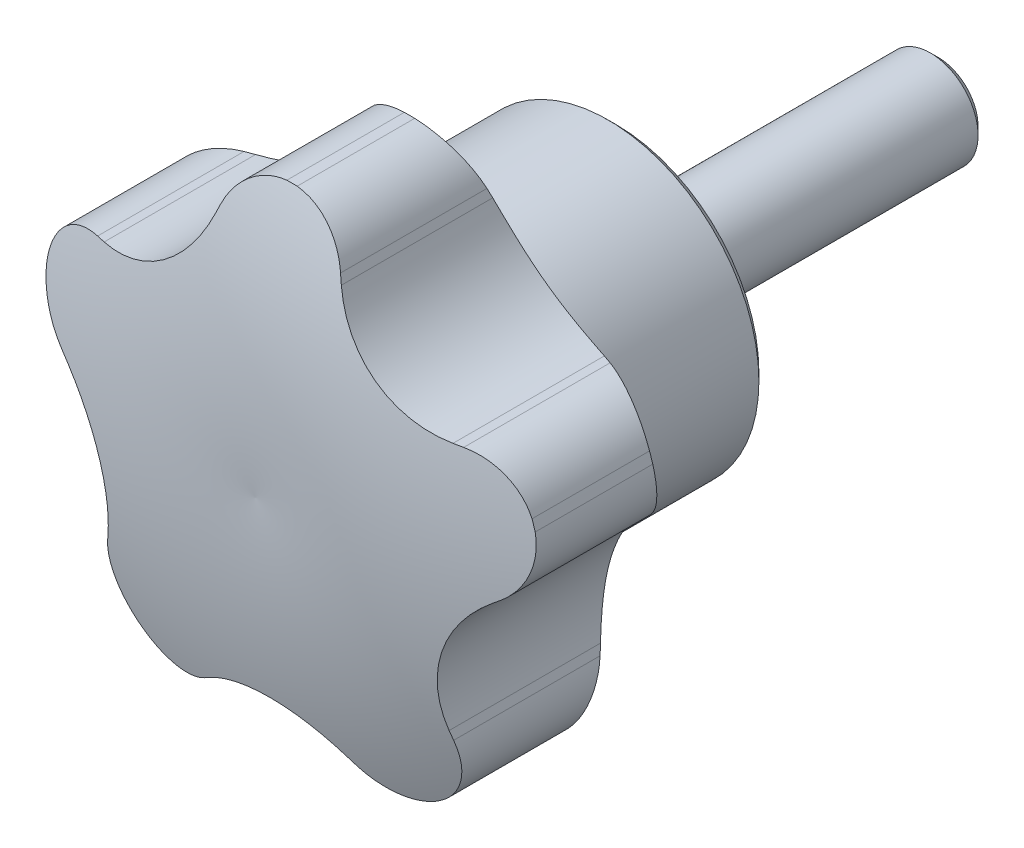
ISO-10303-21;
HEADER;
FILE_DESCRIPTION(('STEP AP214'),'2;1');
FILE_NAME('part.step','',(''),(''),'','','');
FILE_SCHEMA(('AUTOMOTIVE_DESIGN { 1 0 10303 214 1 1 1 1 }'));
ENDSEC;
DATA;
#1=APPLICATION_CONTEXT('core data for automotive mechanical design processes');
#2=APPLICATION_PROTOCOL_DEFINITION('international standard','automotive_design',2000,#1);
#3=PRODUCT_CONTEXT('',#1,'mechanical');
#4=PRODUCT('Part','Part','',(#3));
#5=PRODUCT_RELATED_PRODUCT_CATEGORY('part','',(#4));
#6=PRODUCT_DEFINITION_FORMATION('','',#4);
#7=PRODUCT_DEFINITION_CONTEXT('part definition',#1,'design');
#8=PRODUCT_DEFINITION('design','',#6,#7);
#9=PRODUCT_DEFINITION_SHAPE('','',#8);
#10=(LENGTH_UNIT() NAMED_UNIT(*) SI_UNIT(.MILLI.,.METRE.));
#11=(NAMED_UNIT(*) PLANE_ANGLE_UNIT() SI_UNIT($,.RADIAN.));
#12=(NAMED_UNIT(*) SI_UNIT($,.STERADIAN.) SOLID_ANGLE_UNIT());
#13=UNCERTAINTY_MEASURE_WITH_UNIT(LENGTH_MEASURE(1.E-05),#10,'distance_accuracy_value','');
#14=(GEOMETRIC_REPRESENTATION_CONTEXT(3) GLOBAL_UNCERTAINTY_ASSIGNED_CONTEXT((#13)) GLOBAL_UNIT_ASSIGNED_CONTEXT((#10,
#11,#12)) REPRESENTATION_CONTEXT('',''));
#15=CARTESIAN_POINT('',(0.,0.,0.));
#16=DIRECTION('',(0.,0.,1.));
#17=DIRECTION('',(1.,0.,0.));
#18=AXIS2_PLACEMENT_3D('',#15,#16,#17);
#19=CARTESIAN_POINT('',(0.,0.,0.));
#20=DIRECTION('',(0.,0.,-1.));
#21=DIRECTION('',(-1.,0.,0.));
#22=AXIS2_PLACEMENT_3D('',#19,#20,#21);
#23=CYLINDRICAL_SURFACE('',#22,16.);
#24=CARTESIAN_POINT('',(0.,0.,20.7));
#25=DIRECTION('',(0.,0.,-1.));
#26=DIRECTION('',(-1.,0.,0.));
#27=AXIS2_PLACEMENT_3D('',#24,#25,#26);
#28=CIRCLE('',#27,16.);
#29=CARTESIAN_POINT('',(-15.3145548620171,4.63296982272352,20.7));
#30=VERTEX_POINT('',#29);
#31=CARTESIAN_POINT('',(-15.1129264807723,5.25351817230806,20.7));
#32=VERTEX_POINT('',#31);
#33=EDGE_CURVE('E312',#30,#32,#28,.T.);
#34=ORIENTED_EDGE('',*,*,#33,.T.);
#35=DIRECTION('',(0.,0.,1.));
#36=VECTOR('',#35,1.);
#37=CARTESIAN_POINT('',(-15.1129264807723,5.25351817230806,0.));
#38=LINE('',#37,#36);
#39=CARTESIAN_POINT('',(-15.1129264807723,5.25351817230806,13.2999999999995));
#40=VERTEX_POINT('',#39);
#41=EDGE_CURVE('E592',#32,#40,#38,.F.);
#42=ORIENTED_EDGE('',*,*,#41,.T.);
#43=CARTESIAN_POINT('',(0.,0.,13.3));
#44=DIRECTION('',(0.,0.,-1.));
#45=DIRECTION('',(-1.,0.,0.));
#46=AXIS2_PLACEMENT_3D('',#43,#44,#45);
#47=CIRCLE('',#46,16.);
#48=CARTESIAN_POINT('',(-15.3145548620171,4.63296982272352,13.2999999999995));
#49=VERTEX_POINT('',#48);
#50=EDGE_CURVE('E309',#49,#40,#47,.T.);
#51=ORIENTED_EDGE('',*,*,#50,.F.);
#52=DIRECTION('',(0.,0.,1.));
#53=VECTOR('',#52,1.);
#54=CARTESIAN_POINT('',(-15.3145548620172,4.63296982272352,0.));
#55=LINE('',#54,#53);
#56=EDGE_CURVE('E584',#49,#30,#55,.T.);
#57=ORIENTED_EDGE('',*,*,#56,.T.);
#58=EDGE_LOOP('',(#34,#42,#51,#57));
#59=FACE_BOUND('',#58,.T.);
#60=ADVANCED_FACE('F14',(#59),#23,.T.);
#61=CARTESIAN_POINT('',(-9.1386738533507,-13.1333407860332,20.7));
#62=VERTEX_POINT('',#61);
#63=CARTESIAN_POINT('',(-9.66654380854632,-12.7498208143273,20.7));
#64=VERTEX_POINT('',#63);
#65=EDGE_CURVE('E322',#62,#64,#28,.T.);
#66=ORIENTED_EDGE('',*,*,#65,.T.);
#67=DIRECTION('',(0.,0.,1.));
#68=VECTOR('',#67,1.);
#69=CARTESIAN_POINT('',(-9.6665438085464,-12.7498208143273,0.));
#70=LINE('',#69,#68);
#71=CARTESIAN_POINT('',(-9.66654380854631,-12.7498208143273,13.2999999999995));
#72=VERTEX_POINT('',#71);
#73=EDGE_CURVE('E510',#64,#72,#70,.F.);
#74=ORIENTED_EDGE('',*,*,#73,.T.);
#75=CARTESIAN_POINT('',(-9.13867385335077,-13.1333407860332,13.2999999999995));
#76=VERTEX_POINT('',#75);
#77=EDGE_CURVE('E810',#76,#72,#47,.T.);
#78=ORIENTED_EDGE('',*,*,#77,.F.);
#79=DIRECTION('',(0.,0.,1.));
#80=VECTOR('',#79,1.);
#81=CARTESIAN_POINT('',(-9.13867385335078,-13.1333407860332,0.));
#82=LINE('',#81,#80);
#83=EDGE_CURVE('E502',#76,#62,#82,.T.);
#84=ORIENTED_EDGE('',*,*,#83,.T.);
#85=EDGE_LOOP('',(#66,#74,#78,#84));
#86=FACE_BOUND('',#85,.T.);
#87=ADVANCED_FACE('F835',(#86),#23,.T.);
#88=CARTESIAN_POINT('',(9.6665438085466,-12.7498208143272,20.7));
#89=VERTEX_POINT('',#88);
#90=CARTESIAN_POINT('',(9.13867385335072,-13.1333407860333,20.7));
#91=VERTEX_POINT('',#90);
#92=EDGE_CURVE('E320',#89,#91,#28,.T.);
#93=ORIENTED_EDGE('',*,*,#92,.T.);
#94=DIRECTION('',(0.,0.,1.));
#95=VECTOR('',#94,1.);
#96=CARTESIAN_POINT('',(9.13867385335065,-13.1333407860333,0.));
#97=LINE('',#96,#95);
#98=CARTESIAN_POINT('',(9.1386738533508,-13.1333407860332,13.2999999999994));
#99=VERTEX_POINT('',#98);
#100=EDGE_CURVE('E339',#91,#99,#97,.F.);
#101=ORIENTED_EDGE('',*,*,#100,.T.);
#102=CARTESIAN_POINT('',(9.66654380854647,-12.7498208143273,13.2999999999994));
#103=VERTEX_POINT('',#102);
#104=EDGE_CURVE('E812',#103,#99,#47,.T.);
#105=ORIENTED_EDGE('',*,*,#104,.F.);
#106=DIRECTION('',(0.,0.,1.));
#107=VECTOR('',#106,1.);
#108=CARTESIAN_POINT('',(9.66654380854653,-12.7498208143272,0.));
#109=LINE('',#108,#107);
#110=EDGE_CURVE('E341',#103,#89,#109,.T.);
#111=ORIENTED_EDGE('',*,*,#110,.T.);
#112=EDGE_LOOP('',(#93,#101,#105,#111));
#113=FACE_BOUND('',#112,.T.);
#114=ADVANCED_FACE('F337',(#113),#23,.T.);
#115=CARTESIAN_POINT('',(-0.326241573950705,15.9966736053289,20.7));
#116=VERTEX_POINT('',#115);
#117=CARTESIAN_POINT('',(0.326241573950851,15.9966736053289,20.7));
#118=VERTEX_POINT('',#117);
#119=EDGE_CURVE('E232',#116,#118,#28,.T.);
#120=ORIENTED_EDGE('',*,*,#119,.T.);
#121=DIRECTION('',(0.,0.,1.));
#122=VECTOR('',#121,1.);
#123=CARTESIAN_POINT('',(0.326241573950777,15.9966736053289,0.));
#124=LINE('',#123,#122);
#125=CARTESIAN_POINT('',(0.326241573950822,15.9966736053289,13.2999999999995));
#126=VERTEX_POINT('',#125);
#127=EDGE_CURVE('E671',#118,#126,#124,.F.);
#128=ORIENTED_EDGE('',*,*,#127,.T.);
#129=CARTESIAN_POINT('',(-0.326241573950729,15.9966736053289,13.2999999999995));
#130=VERTEX_POINT('',#129);
#131=EDGE_CURVE('E310',#130,#126,#47,.T.);
#132=ORIENTED_EDGE('',*,*,#131,.F.);
#133=DIRECTION('',(0.,0.,1.));
#134=VECTOR('',#133,1.);
#135=CARTESIAN_POINT('',(-0.326241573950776,15.9966736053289,0.));
#136=LINE('',#135,#134);
#137=EDGE_CURVE('E662',#130,#116,#136,.T.);
#138=ORIENTED_EDGE('',*,*,#137,.T.);
#139=EDGE_LOOP('',(#120,#128,#132,#138));
#140=FACE_BOUND('',#139,.T.);
#141=ADVANCED_FACE('F790',(#140),#23,.T.);
#142=CARTESIAN_POINT('',(-2.59665404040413,0.,-15.7384936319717));
#143=DIRECTION('',(0.,-1.,0.));
#144=DIRECTION('',(-1.,0.,0.));
#145=AXIS2_PLACEMENT_3D('',#142,#143,#144);
#146=CIRCLE('',#145,38.8254233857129);
#147=TRIMMED_CURVE('',#146,(PARAMETER_VALUE(-1.63772653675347)),
(PARAMETER_VALUE(1.63772653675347)),.T.,.PARAMETER.);
#148=CARTESIAN_POINT('',(0.,0.,-15.7384936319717));
#149=DIRECTION('',(0.,0.,-1.));
#150=AXIS1_PLACEMENT('',#148,#149);
#151=SURFACE_OF_REVOLUTION('',#147,#150);
#152=CARTESIAN_POINT('',(0.,0.,23.));
#153=VERTEX_POINT('',#152);
#154=VERTEX_LOOP('',#153);
#155=FACE_BOUND('',#154,.T.);
#156=CARTESIAN_POINT('',(-3.77099647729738,13.3440110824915,21.415260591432));
#157=CARTESIAN_POINT('',(-3.73320410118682,13.4508726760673,21.3871864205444));
#158=CARTESIAN_POINT('',(-3.69082482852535,13.5561957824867,21.3594189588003));
#159=CARTESIAN_POINT('',(-3.59717795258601,13.7630488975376,21.3047121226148));
#160=CARTESIAN_POINT('',(-3.54590951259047,13.8645785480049,21.277772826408));
#161=CARTESIAN_POINT('',(-3.43474465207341,14.0631659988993,21.2249269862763));
#162=CARTESIAN_POINT('',(-3.37484322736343,14.1602211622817,21.1990210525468));
#163=CARTESIAN_POINT('',(-3.24680122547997,14.3490799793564,21.1484760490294));
#164=CARTESIAN_POINT('',(-3.17866104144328,14.4408838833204,21.1238369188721));
#165=CARTESIAN_POINT('',(-3.03449158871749,14.6186333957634,21.0760148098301));
#166=CARTESIAN_POINT('',(-2.95845492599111,14.7045733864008,21.0528332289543));
#167=CARTESIAN_POINT('',(-2.79900496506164,14.869853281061,21.0081525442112));
#168=CARTESIAN_POINT('',(-2.71558910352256,14.9491908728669,20.9866540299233));
#169=CARTESIAN_POINT('',(-2.54199733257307,15.1005508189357,20.9455591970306));
#170=CARTESIAN_POINT('',(-2.45182452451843,15.1725764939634,20.9259620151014));
#171=CARTESIAN_POINT('',(-2.26530938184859,15.3087428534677,20.8888498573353));
#172=CARTESIAN_POINT('',(-2.16896729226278,15.3728838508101,20.8713347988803));
#173=CARTESIAN_POINT('',(-1.97314202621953,15.4913062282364,20.8389499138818));
#174=CARTESIAN_POINT('',(-1.87378667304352,15.5457846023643,20.8240274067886));
#175=CARTESIAN_POINT('',(-1.6705909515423,15.6462016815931,20.7964888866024));
#176=CARTESIAN_POINT('',(-1.56675241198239,15.6921438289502,20.7838719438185));
#177=CARTESIAN_POINT('',(-1.35541384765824,15.7750666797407,20.7610775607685));
#178=CARTESIAN_POINT('',(-1.24791739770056,15.8120558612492,20.7508978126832));
#179=CARTESIAN_POINT('',(-1.03001609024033,15.8767784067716,20.7330730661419));
#180=CARTESIAN_POINT('',(-0.919612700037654,15.9045163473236,20.7254268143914));
#181=CARTESIAN_POINT('',(-0.72716441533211,15.9442185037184,20.7144774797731));
#182=CARTESIAN_POINT('',(-0.645608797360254,15.9584217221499,20.7105585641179));
#183=CARTESIAN_POINT('',(-0.481866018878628,15.9817298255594,20.7041258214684));
#184=CARTESIAN_POINT('',(-0.399680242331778,15.9908437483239,20.7016095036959));
#185=CARTESIAN_POINT('',(-0.317265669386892,15.9973979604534,20.6998));
#186=B_SPLINE_CURVE_WITH_KNOTS('',3,(#156,#157,#158,#159,#160,#161,#162,#163,#164,#165,#166,
#167,#168,#169,#170,#171,#172,#173,#174,#175,#176,#177,#178,#179,#180,#181,#182,#183,#184,#185),
.UNSPECIFIED.,.F.,.F.,(4,2,2,2,2,2,2,2,2,2,2,2,2,2,4),(0.,0.350222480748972,0.700477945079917,
1.05093726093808,1.40137986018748,1.75215361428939,2.10304969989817,2.45378570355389,
2.80450778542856,3.14695123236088,3.48925628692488,3.83123591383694,4.17304611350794,
4.42151117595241,4.66953358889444),.UNSPECIFIED.);
#187=CARTESIAN_POINT('',(-3.77092572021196,13.3442110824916,21.4152080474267));
#188=VERTEX_POINT('',#187);
#189=EDGE_CURVE('E664',#188,#116,#186,.T.);
#190=ORIENTED_EDGE('',*,*,#189,.F.);
#191=CARTESIAN_POINT('',(-3.95260918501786,12.8307129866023,21.5461485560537));
#192=CARTESIAN_POINT('',(-3.92226680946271,12.9164706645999,21.5249399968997));
#193=CARTESIAN_POINT('',(-3.89194943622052,13.0021576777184,21.5034196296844));
#194=CARTESIAN_POINT('',(-3.83136469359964,13.1733903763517,21.4597552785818));
#195=CARTESIAN_POINT('',(-3.8010973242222,13.258936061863,21.4376112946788));
#196=CARTESIAN_POINT('',(-3.77085495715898,13.3444110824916,21.415155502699));
#197=B_SPLINE_CURVE_WITH_KNOTS('',3,(#191,#192,#193,#194,#195,#196),.UNSPECIFIED.,.F.,.F.,(4,2,
4),(0.,0.280215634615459,0.560431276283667),.UNSPECIFIED.);
#198=CARTESIAN_POINT('',(-3.9525384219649,12.8309129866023,21.5460990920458));
#199=VERTEX_POINT('',#198);
#200=EDGE_CURVE('E651',#199,#188,#197,.T.);
#201=ORIENTED_EDGE('',*,*,#200,.F.);
#202=CARTESIAN_POINT('',(-3.95246766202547,12.8311129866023,21.5460496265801));
#203=CARTESIAN_POINT('',(-4.01935057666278,12.6419853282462,21.5928356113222));
#204=CARTESIAN_POINT('',(-4.093930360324,12.454862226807,21.6367985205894));
#205=CARTESIAN_POINT('',(-4.25814425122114,12.0859801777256,21.7188765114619));
#206=CARTESIAN_POINT('',(-4.34778093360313,11.9042221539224,21.7569905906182));
#207=CARTESIAN_POINT('',(-4.54179627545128,11.5473986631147,21.8271712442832));
#208=CARTESIAN_POINT('',(-4.64618254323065,11.3723367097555,21.859234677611));
#209=CARTESIAN_POINT('',(-4.86909539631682,11.030392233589,21.9171386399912));
#210=CARTESIAN_POINT('',(-4.9876208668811,10.8635090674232,21.9429796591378));
#211=CARTESIAN_POINT('',(-5.23830361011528,10.5389870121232,21.988369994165));
#212=CARTESIAN_POINT('',(-5.3704814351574,10.3813626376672,22.0079096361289));
#213=CARTESIAN_POINT('',(-5.64745186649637,10.0768963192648,22.0405756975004));
#214=CARTESIAN_POINT('',(-5.79224454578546,9.93005443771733,22.0537020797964));
#215=CARTESIAN_POINT('',(-6.09330700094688,9.64843857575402,22.0734952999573));
#216=CARTESIAN_POINT('',(-6.24956704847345,9.5136545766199,22.0801675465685));
#217=CARTESIAN_POINT('',(-6.57253039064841,9.25706710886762,22.0870549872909));
#218=CARTESIAN_POINT('',(-6.7392333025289,9.13526316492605,22.0872704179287));
#219=CARTESIAN_POINT('',(-7.07799217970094,8.90812281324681,22.0813121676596));
#220=CARTESIAN_POINT('',(-7.2498442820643,8.80247838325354,22.0752816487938));
#221=CARTESIAN_POINT('',(-7.60108680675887,8.60518068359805,22.0570643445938));
#222=CARTESIAN_POINT('',(-7.78047715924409,8.51352728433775,22.0448776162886));
#223=CARTESIAN_POINT('',(-8.14556763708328,8.34474401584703,22.0143736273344));
#224=CARTESIAN_POINT('',(-8.33127092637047,8.26762155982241,21.9960532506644));
#225=CARTESIAN_POINT('',(-8.70752265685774,8.1283893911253,21.953343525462));
#226=CARTESIAN_POINT('',(-8.8980704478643,8.06627767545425,21.9289549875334));
#227=CARTESIAN_POINT('',(-9.2455117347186,7.96784147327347,21.8794896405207));
#228=CARTESIAN_POINT('',(-9.40180657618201,7.92885382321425,21.8554531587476));
#229=CARTESIAN_POINT('',(-9.71593106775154,7.86088893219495,21.8035583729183));
#230=CARTESIAN_POINT('',(-9.87376067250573,7.83191139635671,21.7757001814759));
#231=CARTESIAN_POINT('',(-10.1899340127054,7.78402260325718,21.7163039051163));
#232=CARTESIAN_POINT('',(-10.3482762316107,7.76509259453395,21.6847728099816));
#233=CARTESIAN_POINT('',(-10.6650823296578,7.7371501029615,21.6180962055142));
#234=CARTESIAN_POINT('',(-10.8235462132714,7.72813800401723,21.5829505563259));
#235=CARTESIAN_POINT('',(-10.981721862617,7.72405240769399,21.5460524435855));
#236=B_SPLINE_CURVE_WITH_KNOTS('',3,(#202,#203,#204,#205,#206,#207,#208,#209,#210,#211,#212,
#213,#214,#215,#216,#217,#218,#219,#220,#221,#222,#223,#224,#225,#226,#227,#228,#229,#230,#231,
#232,#233,#234,#235),.UNSPECIFIED.,.F.,.F.,(4,2,2,2,2,2,2,2,2,2,2,2,2,2,2,2,4),(0.,
0.617822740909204,1.23575125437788,1.85399968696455,2.47219940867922,3.0913437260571,
3.71049162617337,4.32912021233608,4.94772613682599,5.55246035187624,6.15718896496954,
6.76222526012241,7.36718077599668,7.85543723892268,8.34367931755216,8.83100696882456,
9.31835348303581),.UNSPECIFIED.);
#237=CARTESIAN_POINT('',(-10.981521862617,7.72405758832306,21.5460990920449));
#238=VERTEX_POINT('',#237);
#239=EDGE_CURVE('E643',#199,#238,#236,.T.);
#240=ORIENTED_EDGE('',*,*,#239,.T.);
#241=CARTESIAN_POINT('',(-11.5260187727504,7.70994629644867,21.4151584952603));
#242=CARTESIAN_POINT('',(-11.4353858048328,7.71229515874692,21.4376132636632));
#243=CARTESIAN_POINT('',(-11.3446779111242,7.71464596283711,21.4597562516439));
#244=CARTESIAN_POINT('',(-11.1631122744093,7.71935145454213,21.5034186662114));
#245=CARTESIAN_POINT('',(-11.0722545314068,7.72170614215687,21.5249380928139));
#246=CARTESIAN_POINT('',(-10.981321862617,7.72406277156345,21.54614573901));
#247=B_SPLINE_CURVE_WITH_KNOTS('',3,(#241,#242,#243,#244,#245,#246),.UNSPECIFIED.,.F.,.F.,(4,2,
4),(0.,0.280203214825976,0.560406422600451),.UNSPECIFIED.);
#248=CARTESIAN_POINT('',(-11.5258187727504,7.70995147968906,21.4152080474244));
#249=VERTEX_POINT('',#248);
#250=EDGE_CURVE('E652',#249,#238,#247,.T.);
#251=ORIENTED_EDGE('',*,*,#250,.F.);
#252=CARTESIAN_POINT('',(-15.1163890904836,5.24520541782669,20.6998));
#253=CARTESIAN_POINT('',(-15.0741587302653,5.34694466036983,20.7022082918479));
#254=CARTESIAN_POINT('',(-15.0277158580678,5.44689641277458,20.7058758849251));
#255=CARTESIAN_POINT('',(-14.9268181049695,5.64252631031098,20.7156733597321));
#256=CARTESIAN_POINT('',(-14.8723644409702,5.73820510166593,20.7218028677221));
#257=CARTESIAN_POINT('',(-14.7559576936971,5.92444153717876,20.7364544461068));
#258=CARTESIAN_POINT('',(-14.6940193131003,6.0150087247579,20.7449718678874));
#259=CARTESIAN_POINT('',(-14.5630725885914,6.19058003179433,20.7643130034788));
#260=CARTESIAN_POINT('',(-14.4940641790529,6.27558409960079,20.7751367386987));
#261=CARTESIAN_POINT('',(-14.2772082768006,6.52136213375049,20.8109202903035));
#262=CARTESIAN_POINT('',(-14.1194134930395,6.67308773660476,20.839207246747));
#263=CARTESIAN_POINT('',(-13.7822732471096,6.94817964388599,20.9035773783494));
#264=CARTESIAN_POINT('',(-13.6029206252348,7.07153648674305,20.9396631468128));
#265=CARTESIAN_POINT('',(-13.2240833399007,7.28925783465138,21.0191498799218));
#266=CARTESIAN_POINT('',(-13.0242746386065,7.38301095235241,21.0626796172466));
#267=CARTESIAN_POINT('',(-12.6131370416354,7.53617382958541,21.1550869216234));
#268=CARTESIAN_POINT('',(-12.4018144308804,7.5956021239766,21.2039615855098));
#269=CARTESIAN_POINT('',(-12.0782654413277,7.65870241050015,21.280639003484));
#270=CARTESIAN_POINT('',(-11.968101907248,7.67542891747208,21.3070616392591));
#271=CARTESIAN_POINT('',(-11.747194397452,7.69961177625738,21.3606418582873));
#272=CARTESIAN_POINT('',(-11.6364521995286,7.70708816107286,21.3877977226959));
#273=CARTESIAN_POINT('',(-11.5256187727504,7.70995665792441,21.4152575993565));
#274=B_SPLINE_CURVE_WITH_KNOTS('',3,(#252,#253,#254,#255,#256,#257,#258,#259,#260,#261,#262,
#263,#264,#265,#266,#267,#268,#269,#270,#271,#272,#273),.UNSPECIFIED.,.F.,.F.,(4,2,2,2,2,2,2,2,
2,2,4),(0.,0.330431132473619,0.660812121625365,0.990554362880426,1.32029966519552,
1.97913896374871,2.63819768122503,3.31009108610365,3.98162133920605,4.32484055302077,
4.66731514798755),.UNSPECIFIED.);
#275=EDGE_CURVE('E802',#32,#249,#274,.T.);
#276=ORIENTED_EDGE('',*,*,#275,.F.);
#277=ORIENTED_EDGE('',*,*,#33,.F.);
#278=CARTESIAN_POINT('',(-13.8561182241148,0.537024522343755,21.4152894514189));
#279=CARTESIAN_POINT('',(-13.9460733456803,0.605986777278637,21.387215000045));
#280=CARTESIAN_POINT('',(-14.0331479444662,0.678836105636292,21.3594472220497));
#281=CARTESIAN_POINT('',(-14.2009432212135,0.831816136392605,21.3047396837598));
#282=CARTESIAN_POINT('',(-14.2816633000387,0.911947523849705,21.277800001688));
#283=CARTESIAN_POINT('',(-14.4361844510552,1.07903433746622,21.2249533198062));
#284=CARTESIAN_POINT('',(-14.5099814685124,1.16599370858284,21.1990469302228));
#285=CARTESIAN_POINT('',(-14.6500351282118,1.34612577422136,21.1485009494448));
#286=CARTESIAN_POINT('',(-14.716292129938,1.43929817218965,21.123861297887));
#287=CARTESIAN_POINT('',(-14.8407968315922,1.63133585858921,21.0760380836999));
#288=CARTESIAN_POINT('',(-14.8990369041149,1.73020644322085,21.0528559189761));
#289=CARTESIAN_POINT('',(-15.0069606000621,1.93292392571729,21.008174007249));
#290=CARTESIAN_POINT('',(-15.0566412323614,2.03677254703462,20.9866748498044));
#291=CARTESIAN_POINT('',(-15.1469564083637,2.24863870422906,20.9455786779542));
#292=CARTESIAN_POINT('',(-15.187595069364,2.35665431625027,20.9259808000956));
#293=CARTESIAN_POINT('',(-15.2594669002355,2.57611679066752,20.8888672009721));
#294=CARTESIAN_POINT('',(-15.2907004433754,2.6875635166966,20.8713513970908));
#295=CARTESIAN_POINT('',(-15.3428198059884,2.9103978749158,20.8389649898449));
#296=CARTESIAN_POINT('',(-15.3639324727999,3.02172480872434,20.8240417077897));
#297=CARTESIAN_POINT('',(-15.3966501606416,3.24600555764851,20.7965016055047));
#298=CARTESIAN_POINT('',(-15.4082590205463,3.35895869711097,20.7838838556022));
#299=CARTESIAN_POINT('',(-15.4218224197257,3.58557832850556,20.7610878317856));
#300=CARTESIAN_POINT('',(-15.4237861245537,3.69924404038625,20.750907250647));
#301=CARTESIAN_POINT('',(-15.4180119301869,3.92648160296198,20.733080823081));
#302=CARTESIAN_POINT('',(-15.4102788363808,4.04005347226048,20.7254337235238));
#303=CARTESIAN_POINT('',(-15.3885713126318,4.23537020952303,20.7144819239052));
#304=CARTESIAN_POINT('',(-15.3768764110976,4.31734145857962,20.7105616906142));
#305=CARTESIAN_POINT('',(-15.3484404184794,4.48030878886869,20.7041269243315));
#306=CARTESIAN_POINT('',(-15.33170835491,4.56130634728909,20.7016098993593));
#307=CARTESIAN_POINT('',(-15.3124700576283,4.64173025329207,20.6998));
#308=B_SPLINE_CURVE_WITH_KNOTS('',3,(#278,#279,#280,#281,#282,#283,#284,#285,#286,#287,#288,
#289,#290,#291,#292,#293,#294,#295,#296,#297,#298,#299,#300,#301,#302,#303,#304,#305,#306,#307),
.UNSPECIFIED.,.F.,.F.,(4,2,2,2,2,2,2,2,2,2,2,2,2,2,4),(0.,0.350223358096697,0.700479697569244,
1.05093991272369,1.40138341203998,1.75215805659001,2.10305503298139,2.45379189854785,
2.80451484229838,3.14695926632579,3.48926529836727,3.83124598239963,4.17305725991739,
4.42157679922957,4.66965357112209),.UNSPECIFIED.);
#309=CARTESIAN_POINT('',(-13.8563790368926,0.537224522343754,21.4152080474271));
#310=VERTEX_POINT('',#309);
#311=EDGE_CURVE('E586',#310,#30,#308,.T.);
#312=ORIENTED_EDGE('',*,*,#311,.F.);
#313=CARTESIAN_POINT('',(-13.4241249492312,0.205729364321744,21.5461578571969));
#314=CARTESIAN_POINT('',(-13.4963196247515,0.261095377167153,21.5249462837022));
#315=CARTESIAN_POINT('',(-13.5684548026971,0.316415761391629,21.5034228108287));
#316=CARTESIAN_POINT('',(-13.7126061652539,0.426965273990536,21.459752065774));
#317=CARTESIAN_POINT('',(-13.7846223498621,0.48219440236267,21.4376047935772));
#318=CARTESIAN_POINT('',(-13.8565790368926,0.537377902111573,21.4151456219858));
#319=B_SPLINE_CURVE_WITH_KNOTS('',3,(#313,#314,#315,#316,#317,#318),.UNSPECIFIED.,.F.,.F.,(4,2,
4),(0.,0.280256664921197,0.560513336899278),.UNSPECIFIED.);
#320=CARTESIAN_POINT('',(-13.4243249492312,0.205882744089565,21.5460990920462));
#321=VERTEX_POINT('',#320);
#322=EDGE_CURVE('E573',#321,#310,#319,.T.);
#323=ORIENTED_EDGE('',*,*,#322,.F.);
#324=CARTESIAN_POINT('',(-13.4245249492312,0.206036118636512,21.546040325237));
#325=CARTESIAN_POINT('',(-13.265321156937,0.0839838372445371,21.5928267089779));
#326=CARTESIAN_POINT('',(-13.1104022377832,-0.0447691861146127,21.6367900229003));
#327=CARTESIAN_POINT('',(-12.8103179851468,-0.314935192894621,21.7188688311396));
#328=CARTESIAN_POINT('',(-12.66515432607,-0.456350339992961,21.7569833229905));
#329=CARTESIAN_POINT('',(-12.3857474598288,-0.751133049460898,21.8271648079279));
#330=CARTESIAN_POINT('',(-12.2515099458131,-0.904506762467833,21.8592286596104));
#331=CARTESIAN_POINT('',(-11.9951835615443,-1.22217492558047,21.9171334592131));
#332=CARTESIAN_POINT('',(-11.8730937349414,-1.38646851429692,21.9429748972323));
#333=CARTESIAN_POINT('',(-11.6419183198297,-1.72516375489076,21.9883660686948));
#334=CARTESIAN_POINT('',(-11.5328528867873,-1.89958046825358,22.0079061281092));
#335=CARTESIAN_POINT('',(-11.3288748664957,-2.2570794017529,22.0405730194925));
#336=CARTESIAN_POINT('',(-11.2339623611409,-2.44016167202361,22.0536998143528));
#337=CARTESIAN_POINT('',(-11.0591612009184,-2.81351248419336,22.0734938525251));
#338=CARTESIAN_POINT('',(-10.9792600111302,-3.00377486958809,22.0801665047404));
#339=CARTESIAN_POINT('',(-10.8350299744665,-3.3902206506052,22.0870547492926));
#340=CARTESIAN_POINT('',(-10.7707005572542,-3.58640382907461,22.0872705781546));
#341=CARTESIAN_POINT('',(-10.6593575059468,-3.97877251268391,22.0813131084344));
#342=CARTESIAN_POINT('',(-10.611987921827,-4.17485931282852,22.0752829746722));
#343=CARTESIAN_POINT('',(-10.5328845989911,-4.56987886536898,22.0570664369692));
#344=CARTESIAN_POINT('',(-10.501150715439,-4.768811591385,22.0448800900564));
#345=CARTESIAN_POINT('',(-10.453445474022,-5.16819007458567,22.0143768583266));
#346=CARTESIAN_POINT('',(-10.4374821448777,-5.36863655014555,21.9960568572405));
#347=CARTESIAN_POINT('',(-10.4213307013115,-5.76949841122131,21.9533478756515));
#348=CARTESIAN_POINT('',(-10.4211404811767,-5.96991379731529,21.9289597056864));
#349=CARTESIAN_POINT('',(-10.4348857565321,-6.33077257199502,21.8794944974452));
#350=CARTESIAN_POINT('',(-10.4461036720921,-6.49146953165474,21.8554576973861));
#351=CARTESIAN_POINT('',(-10.4785347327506,-6.81122971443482,21.8035620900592));
#352=CARTESIAN_POINT('',(-10.4997475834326,-6.97029298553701,21.7757033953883));
#353=CARTESIAN_POINT('',(-10.5519062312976,-7.28579775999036,21.7163059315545));
#354=CARTESIAN_POINT('',(-10.5828337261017,-7.44224361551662,21.6847741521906));
#355=CARTESIAN_POINT('',(-10.6541588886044,-7.75218620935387,21.618096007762));
#356=CARTESIAN_POINT('',(-10.6945569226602,-7.90568283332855,21.5829495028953));
#357=CARTESIAN_POINT('',(-10.7395514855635,-8.05738286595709,21.5460504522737));
#358=B_SPLINE_CURVE_WITH_KNOTS('',3,(#324,#325,#326,#327,#328,#329,#330,#331,#332,#333,#334,
#335,#336,#337,#338,#339,#340,#341,#342,#343,#344,#345,#346,#347,#348,#349,#350,#351,#352,#353,
#354,#355,#356,#357),.UNSPECIFIED.,.F.,.F.,(4,2,2,2,2,2,2,2,2,2,2,2,2,2,2,2,4),(0.,
0.617823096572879,1.23575196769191,1.85400078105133,2.47220088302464,3.09134559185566,
3.71049388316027,4.32912284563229,4.94772914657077,5.55246347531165,6.15719220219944,
6.76222863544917,7.36718429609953,7.85545229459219,8.34370591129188,8.83104512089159,
9.31840318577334),.UNSPECIFIED.);
#359=CARTESIAN_POINT('',(-10.7394921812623,-8.05718286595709,21.5460990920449));
#360=VERTEX_POINT('',#359);
#361=EDGE_CURVE('E565',#321,#360,#358,.T.);
#362=ORIENTED_EDGE('',*,*,#361,.T.);
#363=CARTESIAN_POINT('',(-10.8943327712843,-8.57939901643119,21.4151563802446));
#364=CARTESIAN_POINT('',(-10.8685587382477,-8.4924733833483,21.4376118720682));
#365=CARTESIAN_POINT('',(-10.8427633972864,-8.40547588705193,21.4597555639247));
#366=CARTESIAN_POINT('',(-10.7911301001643,-8.23133717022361,21.5034193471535));
#367=CARTESIAN_POINT('',(-10.7652921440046,-8.14419594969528,21.5249394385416));
#368=CARTESIAN_POINT('',(-10.7394328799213,-8.05698286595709,21.5461477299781));
#369=B_SPLINE_CURVE_WITH_KNOTS('',3,(#363,#364,#365,#366,#367,#368),.UNSPECIFIED.,.F.,.F.,(4,2,
4),(0.,0.280211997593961,0.56042398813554),.UNSPECIFIED.);
#370=CARTESIAN_POINT('',(-10.8942734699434,-8.57919901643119,21.4152080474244));
#371=VERTEX_POINT('',#370);
#372=EDGE_CURVE('E574',#371,#360,#369,.T.);
#373=ORIENTED_EDGE('',*,*,#372,.F.);
#374=CARTESIAN_POINT('',(-9.6597079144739,-12.7556827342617,20.6998));
#375=CARTESIAN_POINT('',(-9.74341778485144,-12.6840801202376,20.7022082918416));
#376=CARTESIAN_POINT('',(-9.82412591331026,-12.6090235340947,20.7058758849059));
#377=CARTESIAN_POINT('',(-9.97900188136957,-12.4526111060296,20.715673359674));
#378=CARTESIAN_POINT('',(-10.0531707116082,-12.3712562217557,20.7218028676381));
#379=CARTESIAN_POINT('',(-10.19432042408,-12.2029966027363,20.7364544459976));
#380=CARTESIAN_POINT('',(-10.2613149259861,-12.1161029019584,20.7449718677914));
#381=CARTESIAN_POINT('',(-10.38782839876,-11.9373106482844,20.7643130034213));
#382=CARTESIAN_POINT('',(-10.4473473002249,-11.8454120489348,20.7751367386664));
#383=CARTESIAN_POINT('',(-10.6140839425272,-11.5632202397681,20.8109202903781));
#384=CARTESIAN_POINT('',(-10.7096222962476,-11.3662626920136,20.8392072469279));
#385=CARTESIAN_POINT('',(-10.8670681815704,-10.9606151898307,20.9035773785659));
#386=CARTESIAN_POINT('',(-10.9289645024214,-10.7519213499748,20.9396631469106));
#387=CARTESIAN_POINT('',(-11.018962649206,-10.3243460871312,21.0191498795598));
#388=CARTESIAN_POINT('',(-11.0463828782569,-10.1053454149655,21.0626796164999));
#389=CARTESIAN_POINT('',(-11.0650009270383,-9.66700039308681,21.1550869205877));
#390=CARTESIAN_POINT('',(-11.0562183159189,-9.44765629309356,21.2039615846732));
#391=CARTESIAN_POINT('',(-11.0162479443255,-9.12044243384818,21.2806393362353));
#392=CARTESIAN_POINT('',(-10.9981131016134,-9.01050051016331,21.3070623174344));
#393=CARTESIAN_POINT('',(-10.9528473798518,-8.79292933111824,21.3606432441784));
#394=CARTESIAN_POINT('',(-10.9257361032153,-8.68529557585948,21.3877994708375));
#395=CARTESIAN_POINT('',(-10.8942141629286,-8.57899901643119,21.4152597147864));
#396=B_SPLINE_CURVE_WITH_KNOTS('',3,(#374,#375,#376,#377,#378,#379,#380,#381,#382,#383,#384,
#385,#386,#387,#388,#389,#390,#391,#392,#393,#394,#395),.UNSPECIFIED.,.F.,.F.,(4,2,2,2,2,2,2,2,
2,2,4),(0.,0.33043113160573,0.660812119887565,0.990554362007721,1.32029966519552,
1.97913896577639,2.63819768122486,3.31009107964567,3.98162133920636,4.32484495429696,
4.66732393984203),.UNSPECIFIED.);
#397=EDGE_CURVE('E1143',#64,#371,#396,.T.);
#398=ORIENTED_EDGE('',*,*,#397,.F.);
#399=ORIENTED_EDGE('',*,*,#65,.F.);
#400=CARTESIAN_POINT('',(-4.79258748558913,-13.0120505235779,21.4152681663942));
#401=CARTESIAN_POINT('',(-4.88597338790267,-13.0762903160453,21.3871939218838));
#402=CARTESIAN_POINT('',(-4.98216589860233,-13.1365893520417,21.3594263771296));
#403=CARTESIAN_POINT('',(-5.17951226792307,-13.2488943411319,21.3047193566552));
#404=CARTESIAN_POINT('',(-5.28066659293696,-13.3008995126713,21.2777799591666));
#405=CARTESIAN_POINT('',(-5.48732700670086,-13.3962206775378,21.2249338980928));
#406=CARTESIAN_POINT('',(-5.59283559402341,-13.4395315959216,21.1990278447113));
#407=CARTESIAN_POINT('',(-5.80743169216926,-13.517062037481,21.1484825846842));
#408=CARTESIAN_POINT('',(-5.9165190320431,-13.5512819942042,21.1238433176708));
#409=CARTESIAN_POINT('',(-6.13763276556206,-13.610345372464,21.0760209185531));
#410=CARTESIAN_POINT('',(-6.24966183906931,-13.6351799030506,21.0528391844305));
#411=CARTESIAN_POINT('',(-6.47580844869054,-13.6751735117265,21.0081581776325));
#412=CARTESIAN_POINT('',(-6.58992669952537,-13.6903292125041,20.986659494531));
#413=CARTESIAN_POINT('',(-6.81933247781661,-13.710749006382,20.9455643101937));
#414=CARTESIAN_POINT('',(-6.93461944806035,-13.7160176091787,20.9259669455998));
#415=CARTESIAN_POINT('',(-7.16555003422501,-13.7165493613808,20.8888544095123));
#416=CARTESIAN_POINT('',(-7.28119363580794,-13.7118129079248,20.8713391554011));
#417=CARTESIAN_POINT('',(-7.50922677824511,-13.6925170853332,20.8389538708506));
#418=CARTESIAN_POINT('',(-7.62162869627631,-13.6781922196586,20.8240311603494));
#419=CARTESIAN_POINT('',(-7.84504156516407,-13.6399975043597,20.7964922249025));
#420=CARTESIAN_POINT('',(-7.95605305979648,-13.6161315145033,20.7838750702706));
#421=CARTESIAN_POINT('',(-8.17577092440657,-13.5589973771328,20.7610802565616));
#422=CARTESIAN_POINT('',(-8.28447938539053,-13.5257381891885,20.7509002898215));
#423=CARTESIAN_POINT('',(-8.49880889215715,-13.4500221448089,20.7330751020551));
#424=CARTESIAN_POINT('',(-8.60443144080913,-13.4075698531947,20.7254286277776));
#425=CARTESIAN_POINT('',(-8.78346669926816,-13.3265705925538,20.7144786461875));
#426=CARTESIAN_POINT('',(-8.85779949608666,-13.2901223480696,20.7105593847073));
#427=CARTESIAN_POINT('',(-9.00397903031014,-13.2127294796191,20.704126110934));
#428=CARTESIAN_POINT('',(-9.07582996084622,-13.1717929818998,20.7016096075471));
#429=CARTESIAN_POINT('',(-9.14636127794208,-13.1286508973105,20.6998));
#430=B_SPLINE_CURVE_WITH_KNOTS('',3,(#400,#401,#402,#403,#404,#405,#406,#407,#408,#409,#410,
#411,#412,#413,#414,#415,#416,#417,#418,#419,#420,#421,#422,#423,#424,#425,#426,#427,#428,#429),
.UNSPECIFIED.,.F.,.F.,(4,2,2,2,2,2,2,2,2,2,2,2,2,2,4),(0.,0.35022271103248,0.700478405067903,
1.05093795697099,1.40138079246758,1.75215478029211,2.10305109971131,2.45378732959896,
2.80450963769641,3.14695334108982,3.48925865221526,3.83123855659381,4.17304903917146,
4.42152840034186,4.66956508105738),.UNSPECIFIED.);
#431=CARTESIAN_POINT('',(-4.79278748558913,-13.0121880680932,21.415208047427));
#432=VERTEX_POINT('',#431);
#433=EDGE_CURVE('E504',#432,#62,#430,.T.);
#434=ORIENTED_EDGE('',*,*,#433,.F.);
#435=CARTESIAN_POINT('',(-4.34395067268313,-12.7035329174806,21.5461556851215));
#436=CARTESIAN_POINT('',(-4.41891369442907,-12.7550833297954,21.524944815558));
#437=CARTESIAN_POINT('',(-4.49381493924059,-12.8065912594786,21.503422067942));
#438=CARTESIAN_POINT('',(-4.64349387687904,-12.9095221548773,21.4597528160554));
#439=CARTESIAN_POINT('',(-4.71827156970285,-12.9609451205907,21.4376063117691));
#440=CARTESIAN_POINT('',(-4.79298748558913,-13.0123256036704,21.4151479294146));
#441=B_SPLINE_CURVE_WITH_KNOTS('',3,(#435,#436,#437,#438,#439,#440),.UNSPECIFIED.,.F.,.F.,(4,2,
4),(0.,0.280247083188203,0.560494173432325),.UNSPECIFIED.);
#442=CARTESIAN_POINT('',(-4.34415067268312,-12.7036704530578,21.5460990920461));
#443=VERTEX_POINT('',#442);
#444=EDGE_CURVE('E496',#443,#432,#441,.T.);
#445=ORIENTED_EDGE('',*,*,#444,.F.);
#446=CARTESIAN_POINT('',(-4.34435067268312,-12.7038079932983,21.5460424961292));
#447=CARTESIAN_POINT('',(-4.1790752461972,-12.5901126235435,21.5928287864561));
#448=CARTESIAN_POINT('',(-4.00875114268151,-12.4825630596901,21.6367920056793));
#449=CARTESIAN_POINT('',(-3.65907664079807,-12.2806522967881,21.7188706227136));
#450=CARTESIAN_POINT('',(-3.47972470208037,-12.1862933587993,21.7569850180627));
#451=CARTESIAN_POINT('',(-3.11302802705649,-12.0116549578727,21.8271663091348));
#452=CARTESIAN_POINT('',(-2.92567920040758,-11.9313828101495,21.8592300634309));
#453=CARTESIAN_POINT('',(-2.54434946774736,-11.7857672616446,21.9171346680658));
#454=CARTESIAN_POINT('',(-2.35036908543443,-11.7204226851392,21.9429760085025));
#455=CARTESIAN_POINT('',(-1.95681353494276,-11.6052248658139,21.9883669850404));
#456=CARTESIAN_POINT('',(-1.75723027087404,-11.5553954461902,22.0079069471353));
#457=CARTESIAN_POINT('',(-1.35419584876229,-11.471874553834,22.0405736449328));
#458=CARTESIAN_POINT('',(-1.15074466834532,-11.4381831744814,22.0537003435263));
#459=CARTESIAN_POINT('',(-0.741650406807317,-11.3873096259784,22.0734941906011));
#460=CARTESIAN_POINT('',(-0.5360093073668,-11.370113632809,22.0801667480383));
#461=CARTESIAN_POINT('',(-0.123908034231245,-11.3523615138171,22.0870548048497));
#462=CARTESIAN_POINT('',(0.0825521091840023,-11.3518047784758,22.0872705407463));
#463=CARTESIAN_POINT('',(0.490123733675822,-11.3671603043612,22.081312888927));
#464=CARTESIAN_POINT('',(0.691251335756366,-11.38270353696,22.0752826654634));
#465=CARTESIAN_POINT('',(1.09138143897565,-11.4295400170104,22.0570659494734));
#466=CARTESIAN_POINT('',(1.29038395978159,-11.4608331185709,22.0448795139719));
#467=CARTESIAN_POINT('',(1.68495707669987,-11.5388779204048,22.014376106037));
#468=CARTESIAN_POINT('',(1.88052587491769,-11.5856374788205,21.9960560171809));
#469=CARTESIAN_POINT('',(2.26675907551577,-11.6941501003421,21.9533468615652));
#470=CARTESIAN_POINT('',(2.45742412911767,-11.7559011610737,21.9289586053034));
#471=CARTESIAN_POINT('',(2.79637556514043,-11.8804863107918,21.8794929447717));
#472=CARTESIAN_POINT('',(2.94574283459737,-11.9408143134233,21.8554557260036));
#473=CARTESIAN_POINT('',(3.23983475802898,-12.0704717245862,21.8035591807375));
#474=CARTESIAN_POINT('',(3.38455954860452,-12.1398008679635,21.7756999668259));
#475=CARTESIAN_POINT('',(3.66850787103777,-12.2869057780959,21.7163013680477));
#476=CARTESIAN_POINT('',(3.80774119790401,-12.3646654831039,21.6847689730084));
#477=CARTESIAN_POINT('',(4.08047644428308,-12.5282804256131,21.6180895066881));
#478=CARTESIAN_POINT('',(4.21397814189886,-12.6141359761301,21.58294229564));
#479=CARTESIAN_POINT('',(4.3443506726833,-12.7038079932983,21.5460424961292));
#480=B_SPLINE_CURVE_WITH_KNOTS('',3,(#446,#447,#448,#449,#450,#451,#452,#453,#454,#455,#456,
#457,#458,#459,#460,#461,#462,#463,#464,#465,#466,#467,#468,#469,#470,#471,#472,#473,#474,#475,
#476,#477,#478,#479),.UNSPECIFIED.,.F.,.F.,(4,2,2,2,2,2,2,2,2,2,2,2,2,2,2,2,4),(0.,
0.617823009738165,1.23575179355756,1.85400052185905,2.47220053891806,3.091345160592,
3.71049336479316,4.329122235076,4.94772844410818,5.55246273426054,6.15719142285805,
6.76222783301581,7.36718347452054,7.85545804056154,8.34371822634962,8.83106401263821,
9.31842864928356),.UNSPECIFIED.);
#481=CARTESIAN_POINT('',(4.34415067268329,-12.7036704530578,21.5460990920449));
#482=VERTEX_POINT('',#481);
#483=EDGE_CURVE('E355',#443,#482,#480,.T.);
#484=ORIENTED_EDGE('',*,*,#483,.T.);
#485=CARTESIAN_POINT('',(4.79298748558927,-13.0123256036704,21.4151479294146));
#486=CARTESIAN_POINT('',(4.71827156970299,-12.9609451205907,21.4376063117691));
#487=CARTESIAN_POINT('',(4.64349387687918,-12.9095221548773,21.4597528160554));
#488=CARTESIAN_POINT('',(4.49381493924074,-12.8065912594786,21.5034220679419));
#489=CARTESIAN_POINT('',(4.41891369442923,-12.7550833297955,21.5249448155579));
#490=CARTESIAN_POINT('',(4.3439506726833,-12.7035329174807,21.5461556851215));
#491=B_SPLINE_CURVE_WITH_KNOTS('',3,(#485,#486,#487,#488,#489,#490),.UNSPECIFIED.,.F.,.F.,(4,2,
4),(0.,0.280247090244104,0.560494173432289),.UNSPECIFIED.);
#492=CARTESIAN_POINT('',(4.79278748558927,-13.0121880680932,21.4152080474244));
#493=VERTEX_POINT('',#492);
#494=EDGE_CURVE('E351',#493,#482,#491,.T.);
#495=ORIENTED_EDGE('',*,*,#494,.F.);
#496=CARTESIAN_POINT('',(9.14636127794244,-13.1286508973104,20.6998));
#497=CARTESIAN_POINT('',(9.05239537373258,-13.1861372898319,20.7022082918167));
#498=CARTESIAN_POINT('',(8.95607213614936,-13.2397015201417,20.705875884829));
#499=CARTESIAN_POINT('',(8.75945577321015,-13.3386632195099,20.715673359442));
#500=CARTESIAN_POINT('',(8.6591632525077,-13.384061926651,20.721802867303));
#501=CARTESIAN_POINT('',(8.4555211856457,-13.4663081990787,20.7364544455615));
#502=CARTESIAN_POINT('',(8.35217792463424,-13.5031721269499,20.7449718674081));
#503=CARTESIAN_POINT('',(8.14304157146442,-13.5682437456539,20.7643130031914));
#504=CARTESIAN_POINT('',(8.03724845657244,-13.596451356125,20.7751367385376));
#505=CARTESIAN_POINT('',(7.71734363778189,-13.667825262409,20.8109202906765));
#506=CARTESIAN_POINT('',(7.50050290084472,-13.6978244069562,20.8392072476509));
#507=CARTESIAN_POINT('',(7.06605574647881,-13.7222123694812,20.9035773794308));
#508=CARTESIAN_POINT('',(6.84844909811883,-13.7165893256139,20.9396631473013));
#509=CARTESIAN_POINT('',(6.41398991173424,-13.6700546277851,21.0191498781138));
#510=CARTESIAN_POINT('',(6.19723458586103,-13.6284578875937,21.0626796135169));
#511=CARTESIAN_POINT('',(5.77459040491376,-13.5107086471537,21.1550869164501));
#512=CARTESIAN_POINT('',(5.56869574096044,-13.4345748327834,21.2039615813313));
#513=CARTESIAN_POINT('',(5.26984319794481,-13.2954436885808,21.280640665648));
#514=CARTESIAN_POINT('',(5.17088122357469,-13.2442196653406,21.3070650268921));
#515=CARTESIAN_POINT('',(4.97793721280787,-13.1339297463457,21.3606487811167));
#516=CARTESIAN_POINT('',(4.88394483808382,-13.0748811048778,21.3878064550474));
#517=CARTESIAN_POINT('',(4.79258748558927,-13.0120505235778,21.4152681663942));
#518=B_SPLINE_CURVE_WITH_KNOTS('',3,(#496,#497,#498,#499,#500,#501,#502,#503,#504,#505,#506,
#507,#508,#509,#510,#511,#512,#513,#514,#515,#516,#517),.UNSPECIFIED.,.F.,.F.,(4,2,2,2,2,2,2,2,
2,2,4),(0.,0.330431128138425,0.660812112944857,0.990554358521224,1.32029966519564,
1.97913897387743,2.63819768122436,3.31009105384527,3.98162133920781,4.32486253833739,
4.66735906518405),.UNSPECIFIED.);
#519=EDGE_CURVE('E349',#91,#493,#518,.T.);
#520=ORIENTED_EDGE('',*,*,#519,.F.);
#521=ORIENTED_EDGE('',*,*,#92,.F.);
#522=CARTESIAN_POINT('',(10.8942141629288,-8.57899901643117,21.4152597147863));
#523=CARTESIAN_POINT('',(10.9264510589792,-8.68766568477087,21.3871855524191));
#524=CARTESIAN_POINT('',(10.954072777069,-8.79778379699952,21.3594181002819));
#525=CARTESIAN_POINT('',(10.9998958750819,-9.02017576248,21.3047112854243));
#526=CARTESIAN_POINT('',(11.0180963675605,-9.13244981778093,21.2777720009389));
#527=CARTESIAN_POINT('',(11.044888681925,-9.35845151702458,21.2249261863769));
#528=CARTESIAN_POINT('',(11.0534749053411,-9.472179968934,21.1990202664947));
#529=CARTESIAN_POINT('',(11.0608949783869,-9.70023115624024,21.1484752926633));
#530=CARTESIAN_POINT('',(11.0597292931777,-9.81455386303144,21.1238361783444));
#531=CARTESIAN_POINT('',(11.0475721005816,-10.0430968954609,21.076014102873));
#532=CARTESIAN_POINT('',(11.0365713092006,-10.1573170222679,21.0528325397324));
#533=CARTESIAN_POINT('',(11.0047224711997,-10.3847535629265,21.0081518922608));
#534=CARTESIAN_POINT('',(10.9838709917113,-10.4979696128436,20.9866533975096));
#535=CARTESIAN_POINT('',(10.9323992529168,-10.7224570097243,20.9455586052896));
#536=CARTESIAN_POINT('',(10.9017834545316,-10.8337292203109,20.9259614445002));
#537=CARTESIAN_POINT('',(10.8309259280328,-11.0535208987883,20.8888493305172));
#538=CARTESIAN_POINT('',(10.7906845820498,-11.1620404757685,20.8713342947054));
#539=CARTESIAN_POINT('',(10.7018653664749,-11.3729493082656,20.838949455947));
#540=CARTESIAN_POINT('',(10.6535066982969,-11.4754228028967,20.8240269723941));
#541=CARTESIAN_POINT('',(10.5481414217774,-11.6760972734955,20.796488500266));
#542=CARTESIAN_POINT('',(10.4911383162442,-11.7742999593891,20.7838715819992));
#543=CARTESIAN_POINT('',(10.3689025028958,-11.9656075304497,20.7610772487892));
#544=CARTESIAN_POINT('',(10.3036776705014,-12.0587171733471,20.7508975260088));
#545=CARTESIAN_POINT('',(10.1654346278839,-12.239157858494,20.7330728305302));
#546=CARTESIAN_POINT('',(10.0924202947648,-12.3264917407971,20.7254266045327));
#547=CARTESIAN_POINT('',(9.96006296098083,-12.4717292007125,20.714477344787));
#548=CARTESIAN_POINT('',(9.90243186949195,-12.5311566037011,20.710558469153));
#549=CARTESIAN_POINT('',(9.78366208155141,-12.6462580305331,20.704125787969));
#550=CARTESIAN_POINT('',(9.72252981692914,-12.7019385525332,20.7016094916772));
#551=CARTESIAN_POINT('',(9.65970791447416,-12.7556827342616,20.6998));
#552=B_SPLINE_CURVE_WITH_KNOTS('',3,(#522,#523,#524,#525,#526,#527,#528,#529,#530,#531,#532,
#533,#534,#535,#536,#537,#538,#539,#540,#541,#542,#543,#544,#545,#546,#547,#548,#549,#550,#551),
.UNSPECIFIED.,.F.,.F.,(4,2,2,2,2,2,2,2,2,2,2,2,2,2,4),(0.,0.350222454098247,0.700477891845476,
1.05093718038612,1.4013797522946,1.75215347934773,2.10304953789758,2.45378551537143,
2.80450757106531,3.14695098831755,3.48925601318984,3.83123560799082,4.17304577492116,
4.42150918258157,4.66952994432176),.UNSPECIFIED.);
#553=CARTESIAN_POINT('',(10.8942734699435,-8.57919901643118,21.4152080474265));
#554=VERTEX_POINT('',#553);
#555=EDGE_CURVE('E347',#554,#89,#552,.T.);
#556=ORIENTED_EDGE('',*,*,#555,.F.);
#557=CARTESIAN_POINT('',(10.7394328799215,-8.05698286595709,21.546147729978));
#558=CARTESIAN_POINT('',(10.7652921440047,-8.14419594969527,21.5249394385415));
#559=CARTESIAN_POINT('',(10.7911301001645,-8.2313371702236,21.5034193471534));
#560=CARTESIAN_POINT('',(10.8427633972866,-8.40547588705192,21.4597555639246));
#561=CARTESIAN_POINT('',(10.8685587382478,-8.49247338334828,21.4376118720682));
#562=CARTESIAN_POINT('',(10.8943327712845,-8.57939901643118,21.4151563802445));
#563=B_SPLINE_CURVE_WITH_KNOTS('',3,(#557,#558,#559,#560,#561,#562),.UNSPECIFIED.,.F.,.F.,(4,2,
4),(0.,0.280211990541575,0.560423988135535),.UNSPECIFIED.);
#564=CARTESIAN_POINT('',(10.7394921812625,-8.05718286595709,21.5460990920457));
#565=VERTEX_POINT('',#564);
#566=EDGE_CURVE('E405',#565,#554,#563,.T.);
#567=ORIENTED_EDGE('',*,*,#566,.F.);
#568=CARTESIAN_POINT('',(10.7395514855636,-8.05738286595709,21.5460504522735));
#569=CARTESIAN_POINT('',(10.6824945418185,-7.86506256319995,21.5928364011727));
#570=CARTESIAN_POINT('',(10.6328427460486,-7.66983987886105,21.6367992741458));
#571=CARTESIAN_POINT('',(10.5488713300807,-7.27488550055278,21.7188771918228));
#572=CARTESIAN_POINT('',(10.5145543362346,-7.07515304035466,21.7569912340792));
#573=CARTESIAN_POINT('',(10.4617806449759,-6.67243740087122,21.8271718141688));
#574=CARTESIAN_POINT('',(10.4433321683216,-6.46945259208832,21.8592352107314));
#575=CARTESIAN_POINT('',(10.4226827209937,-6.06178881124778,21.917139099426));
#576=CARTESIAN_POINT('',(10.4204804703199,-5.85710997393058,21.9429800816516));
#577=CARTESIAN_POINT('',(10.4325379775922,-5.44721851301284,21.9883703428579));
#578=CARTESIAN_POINT('',(10.4468228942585,-5.24200555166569,22.0079099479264));
#579=CARTESIAN_POINT('',(10.4919360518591,-4.83288802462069,22.0405759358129));
#580=CARTESIAN_POINT('',(10.5227643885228,-4.6289834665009,22.0537022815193));
#581=CARTESIAN_POINT('',(10.6007995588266,-4.22419143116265,22.0734954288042));
#582=CARTESIAN_POINT('',(10.6479926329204,-4.02330156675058,22.0801676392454));
#583=CARTESIAN_POINT('',(10.7584573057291,-3.62588492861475,22.0870550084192));
#584=CARTESIAN_POINT('',(10.8217283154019,-3.42935799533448,22.0872704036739));
#585=CARTESIAN_POINT('',(10.9622804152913,-3.04648020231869,22.0813120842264));
#586=CARTESIAN_POINT('',(11.0392155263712,-2.85999997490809,22.0752815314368));
#587=CARTESIAN_POINT('',(11.2074081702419,-2.49392769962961,22.0570641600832));
#588=CARTESIAN_POINT('',(11.2986655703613,-2.31433558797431,22.0448773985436));
#589=CARTESIAN_POINT('',(11.4948218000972,-1.96319235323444,22.0143733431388));
#590=CARTESIAN_POINT('',(11.5997275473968,-1.79164536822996,21.9960529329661));
#591=CARTESIAN_POINT('',(11.8222831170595,-1.45784905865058,21.9533431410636));
#592=CARTESIAN_POINT('',(11.9399312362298,-1.29559849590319,21.9289545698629));
#593=CARTESIAN_POINT('',(12.1631604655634,-1.01173792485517,21.8794885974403));
#594=CARTESIAN_POINT('',(12.2666920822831,-0.888325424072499,21.8554514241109));
#595=CARTESIAN_POINT('',(12.4808813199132,-0.648697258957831,21.8035550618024));
#596=CARTESIAN_POINT('',(12.5915387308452,-0.532481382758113,21.7756959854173));
#597=CARTESIAN_POINT('',(12.8191866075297,-0.307891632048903,21.7162977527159));
#598=CARTESIAN_POINT('',(12.9361648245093,-0.199503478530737,21.6847655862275));
#599=CARTESIAN_POINT('',(13.1760493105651,0.00932045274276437,21.61808666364));
#600=CARTESIAN_POINT('',(13.2989558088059,0.109755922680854,21.5829397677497));
#601=CARTESIAN_POINT('',(13.4245249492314,0.206036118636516,21.5460403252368));
#602=B_SPLINE_CURVE_WITH_KNOTS('',3,(#568,#569,#570,#571,#572,#573,#574,#575,#576,#577,#578,
#579,#580,#581,#582,#583,#584,#585,#586,#587,#588,#589,#590,#591,#592,#593,#594,#595,#596,#597,
#598,#599,#600,#601),.UNSPECIFIED.,.F.,.F.,(4,2,2,2,2,2,2,2,2,2,2,2,2,2,2,2,4),(0.,
0.617822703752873,1.23575117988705,1.85399958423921,2.47219927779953,3.09134356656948,
3.71049143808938,4.32911998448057,4.9477258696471,5.55246005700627,6.15718864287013,
6.76222493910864,7.36718046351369,7.85544942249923,8.34370400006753,8.83104416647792,
9.31840318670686),.UNSPECIFIED.);
#603=CARTESIAN_POINT('',(13.4243249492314,0.205882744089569,21.5460990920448));
#604=VERTEX_POINT('',#603);
#605=EDGE_CURVE('E411',#565,#604,#602,.T.);
#606=ORIENTED_EDGE('',*,*,#605,.T.);
#607=CARTESIAN_POINT('',(13.8565790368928,0.537377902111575,21.4151456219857));
#608=CARTESIAN_POINT('',(13.7846223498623,0.482194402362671,21.4376047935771));
#609=CARTESIAN_POINT('',(13.7126061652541,0.426965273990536,21.4597520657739));
#610=CARTESIAN_POINT('',(13.5684548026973,0.31641576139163,21.5034228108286));
#611=CARTESIAN_POINT('',(13.4963196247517,0.261095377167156,21.5249462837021));
#612=CARTESIAN_POINT('',(13.4241249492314,0.20572936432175,21.5461578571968));
#613=B_SPLINE_CURVE_WITH_KNOTS('',3,(#607,#608,#609,#610,#611,#612),.UNSPECIFIED.,.F.,.F.,(4,2,
4),(0.,0.280256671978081,0.560513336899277),.UNSPECIFIED.);
#614=CARTESIAN_POINT('',(13.8563790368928,0.537224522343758,21.4152080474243));
#615=VERTEX_POINT('',#614);
#616=EDGE_CURVE('E418',#615,#604,#613,.T.);
#617=ORIENTED_EDGE('',*,*,#616,.F.);
#618=CARTESIAN_POINT('',(15.3124700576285,4.64173025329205,20.6998));
#619=CARTESIAN_POINT('',(15.3381058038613,4.53459909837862,20.702208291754));
#620=CARTESIAN_POINT('',(15.3592828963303,4.42643800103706,20.7058758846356));
#621=CARTESIAN_POINT('',(15.3926432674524,4.20886388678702,20.715673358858));
#622=CARTESIAN_POINT('',(15.4048279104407,4.09945106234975,20.721802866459));
#623=CARTESIAN_POINT('',(15.4201199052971,3.88036045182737,20.7364544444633));
#624=CARTESIAN_POINT('',(15.4232447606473,3.7706835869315,20.7449718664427));
#625=CARTESIAN_POINT('',(15.4205048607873,3.55167485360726,20.7643130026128));
#626=CARTESIAN_POINT('',(15.4146400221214,3.44234298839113,20.7751367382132));
#627=CARTESIAN_POINT('',(15.3836646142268,3.11603966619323,20.8109202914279));
#628=CARTESIAN_POINT('',(15.345188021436,2.90054161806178,20.8392072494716));
#629=CARTESIAN_POINT('',(15.2341307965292,2.47982152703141,20.9035773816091));
#630=CARTESIAN_POINT('',(15.1615388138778,2.27460292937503,20.9396631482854));
#631=CARTESIAN_POINT('',(14.9830264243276,1.87578772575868,21.0191498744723));
#632=CARTESIAN_POINT('',(14.8764845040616,1.68249527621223,21.0626796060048));
#633=CARTESIAN_POINT('',(14.6338940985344,1.31692329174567,21.1550869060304));
#634=CARTESIAN_POINT('',(14.4978615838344,1.14463246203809,21.2039615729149));
#635=CARTESIAN_POINT('',(14.2731796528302,0.903390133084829,21.2806440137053));
#636=CARTESIAN_POINT('',(14.1938711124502,0.825091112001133,21.3070718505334));
#637=CARTESIAN_POINT('',(14.0293333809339,0.675654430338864,21.3606627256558));
#638=CARTESIAN_POINT('',(13.9441174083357,0.604501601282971,21.3878240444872));
#639=CARTESIAN_POINT('',(13.856118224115,0.537024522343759,21.4152894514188));
#640=B_SPLINE_CURVE_WITH_KNOTS('',3,(#618,#619,#620,#621,#622,#623,#624,#625,#626,#627,#628,
#629,#630,#631,#632,#633,#634,#635,#636,#637,#638,#639),.UNSPECIFIED.,.F.,.F.,(4,2,2,2,2,2,2,2,
2,2,4),(0.,0.330431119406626,0.660812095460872,0.99055434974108,1.32029966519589,
1.9791389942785,2.63819768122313,3.31009098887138,3.98162133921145,4.32490682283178,
4.66744752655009),.UNSPECIFIED.);
#641=CARTESIAN_POINT('',(15.3145548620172,4.63296982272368,20.7));
#642=VERTEX_POINT('',#641);
#643=EDGE_CURVE('E821',#642,#615,#640,.T.);
#644=ORIENTED_EDGE('',*,*,#643,.F.);
#645=CARTESIAN_POINT('',(15.1129264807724,5.25351817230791,20.7));
#646=VERTEX_POINT('',#645);
#647=EDGE_CURVE('E315',#646,#642,#28,.T.);
#648=ORIENTED_EDGE('',*,*,#647,.F.);
#649=CARTESIAN_POINT('',(11.5256187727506,7.70995665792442,21.4152575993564));
#650=CARTESIAN_POINT('',(11.6389286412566,7.70703567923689,21.38718345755));
#651=CARTESIAN_POINT('',(11.7521927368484,7.699276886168,21.3594160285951));
#652=CARTESIAN_POINT('',(11.9778600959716,7.67413386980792,21.304709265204));
#653=CARTESIAN_POINT('',(12.0902632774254,7.65674874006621,21.2777700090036));
#654=CARTESIAN_POINT('',(12.3134828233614,7.61239091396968,21.224924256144));
#655=CARTESIAN_POINT('',(12.4242982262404,7.58541264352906,21.199018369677));
#656=CARTESIAN_POINT('',(12.6434805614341,7.52199740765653,21.1484734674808));
#657=CARTESIAN_POINT('',(12.7518476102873,7.48556089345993,21.1238343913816));
#658=CARTESIAN_POINT('',(12.9654479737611,7.40337459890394,21.0760123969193));
#659=CARTESIAN_POINT('',(13.0706782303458,7.35761605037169,21.0528308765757));
#660=CARTESIAN_POINT('',(13.2771411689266,7.25704383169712,21.0081503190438));
#661=CARTESIAN_POINT('',(13.3783724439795,7.20222700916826,20.9866518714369));
#662=CARTESIAN_POINT('',(13.5759667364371,7.0839036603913,20.9455571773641));
#663=CARTESIAN_POINT('',(13.6723319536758,7.0204011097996,20.9259600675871));
#664=CARTESIAN_POINT('',(13.8594697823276,6.88509186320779,20.8888480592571));
#665=CARTESIAN_POINT('',(13.9502426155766,6.81328549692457,20.8713330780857));
#666=CARTESIAN_POINT('',(14.1233818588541,6.66363865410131,20.8389483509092));
#667=CARTESIAN_POINT('',(14.2058961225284,6.58598061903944,20.8240259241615));
#668=CARTESIAN_POINT('',(14.3641888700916,6.4237601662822,20.796487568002));
#669=CARTESIAN_POINT('',(14.4399700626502,6.33920055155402,20.7838707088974));
#670=CARTESIAN_POINT('',(14.5841410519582,6.16382983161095,20.7610764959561));
#671=CARTESIAN_POINT('',(14.6525378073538,6.07302474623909,20.7508968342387));
#672=CARTESIAN_POINT('',(14.7814272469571,5.88578833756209,20.7330722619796));
#673=CARTESIAN_POINT('',(14.8419238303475,5.78935982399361,20.7254260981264));
#674=CARTESIAN_POINT('',(14.939151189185,5.61860065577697,20.7144770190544));
#675=CARTESIAN_POINT('',(14.9778602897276,5.5454272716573,20.7105582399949));
#676=CARTESIAN_POINT('',(15.0506250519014,5.39690450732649,20.704125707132));
#677=CARTESIAN_POINT('',(15.0846888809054,5.32155923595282,20.7016094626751));
#678=CARTESIAN_POINT('',(15.1163890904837,5.24520541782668,20.6998));
#679=B_SPLINE_CURVE_WITH_KNOTS('',3,(#649,#650,#651,#652,#653,#654,#655,#656,#657,#658,#659,
#660,#661,#662,#663,#664,#665,#666,#667,#668,#669,#670,#671,#672,#673,#674,#675,#676,#677,#678),
.UNSPECIFIED.,.F.,.F.,(4,2,2,2,2,2,2,2,2,2,2,2,2,2,4),(0.,0.350222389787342,0.70047776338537,
1.05093698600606,1.4013794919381,1.7521531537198,2.10304914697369,2.45378506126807,
2.80450705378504,3.14695039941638,3.48925535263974,3.83123486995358,4.17304495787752,
4.42150437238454,4.66952114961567),.UNSPECIFIED.);
#680=CARTESIAN_POINT('',(11.5258187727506,7.70995147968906,21.4152080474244));
#681=VERTEX_POINT('',#680);
#682=EDGE_CURVE('E710',#681,#646,#679,.T.);
#683=ORIENTED_EDGE('',*,*,#682,.F.);
#684=CARTESIAN_POINT('',(10.9813218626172,7.72406277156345,21.5461457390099));
#685=CARTESIAN_POINT('',(11.0722545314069,7.72170614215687,21.5249380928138));
#686=CARTESIAN_POINT('',(11.1631122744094,7.71935145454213,21.5034186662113));
#687=CARTESIAN_POINT('',(11.3446779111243,7.71464596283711,21.4597562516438));
#688=CARTESIAN_POINT('',(11.435385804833,7.71229515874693,21.4376132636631));
#689=CARTESIAN_POINT('',(11.5260187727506,7.70994629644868,21.4151584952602));
#690=B_SPLINE_CURVE_WITH_KNOTS('',3,(#684,#685,#686,#687,#688,#689),.UNSPECIFIED.,.F.,.F.,(4,2,
4),(0.,0.280203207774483,0.560406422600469),.UNSPECIFIED.);
#691=CARTESIAN_POINT('',(10.9815218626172,7.72405758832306,21.5460990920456));
#692=VERTEX_POINT('',#691);
#693=EDGE_CURVE('E239',#692,#681,#690,.T.);
#694=ORIENTED_EDGE('',*,*,#693,.F.);
#695=CARTESIAN_POINT('',(10.9817218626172,7.72405240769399,21.5460524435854));
#696=CARTESIAN_POINT('',(10.7811828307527,7.72921849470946,21.5928383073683));
#697=CARTESIAN_POINT('',(10.5801717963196,7.74232418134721,21.6368010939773));
#698=CARTESIAN_POINT('',(10.1785993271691,7.78451067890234,21.7188788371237));
#699=CARTESIAN_POINT('',(9.97803797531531,7.81359422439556,21.7569927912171));
#700=CARTESIAN_POINT('',(9.57872477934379,7.88784987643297,21.8271731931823));
#701=CARTESIAN_POINT('',(9.379973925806,7.93303030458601,21.8592364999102));
#702=CARTESIAN_POINT('',(8.98588174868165,8.03936697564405,21.9171402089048));
#703=CARTESIAN_POINT('',(8.79054015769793,8.10052195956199,21.9429811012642));
#704=CARTESIAN_POINT('',(8.40443637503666,8.23865316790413,21.9883711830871));
#705=CARTESIAN_POINT('',(8.21368163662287,8.31565342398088,22.0079106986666));
#706=CARTESIAN_POINT('',(7.83852870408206,8.48498324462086,22.040576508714));
#707=CARTESIAN_POINT('',(7.65413054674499,8.57731289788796,22.0537027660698));
#708=CARTESIAN_POINT('',(7.29326489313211,8.77661673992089,22.0734957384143));
#709=CARTESIAN_POINT('',(7.11679087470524,8.8835785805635,22.080167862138));
#710=CARTESIAN_POINT('',(6.77296093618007,9.11144556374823,22.0870550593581));
#711=CARTESIAN_POINT('',(6.60560468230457,9.23235019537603,22.0872703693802));
#712=CARTESIAN_POINT('',(6.2848995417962,9.4843392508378,22.081311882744));
#713=CARTESIAN_POINT('',(6.13132070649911,9.61513460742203,22.0752812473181));
#714=CARTESIAN_POINT('',(5.83513996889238,9.88821817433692,22.0570637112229));
#715=CARTESIAN_POINT('',(5.69253796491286,10.0305062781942,22.0448768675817));
#716=CARTESIAN_POINT('',(5.41919684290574,10.3255714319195,22.0143726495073));
#717=CARTESIAN_POINT('',(5.28846379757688,10.4783537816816,21.9960521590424));
#718=CARTESIAN_POINT('',(5.03977845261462,10.7931656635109,21.9533422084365));
#719=CARTESIAN_POINT('',(4.92182444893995,10.9551939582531,21.9289535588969));
#720=CARTESIAN_POINT('',(4.72084120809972,11.2552121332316,21.8794879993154));
#721=CARTESIAN_POINT('',(4.63546414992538,11.3918097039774,21.8554514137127));
#722=CARTESIAN_POINT('',(4.47375623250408,11.6695579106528,21.8035564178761));
#723=CARTESIAN_POINT('',(4.39742510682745,11.8107084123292,21.7756981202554));
#724=CARTESIAN_POINT('',(4.25417759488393,12.0966090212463,21.7163016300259));
#725=CARTESIAN_POINT('',(4.18724384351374,12.2413518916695,21.6847704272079));
#726=CARTESIAN_POINT('',(4.06277088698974,12.534018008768,21.6180936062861));
#727=CARTESIAN_POINT('',(4.00523204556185,12.6819413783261,21.5829478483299));
#728=CARTESIAN_POINT('',(3.95246766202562,12.8311129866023,21.5460496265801));
#729=B_SPLINE_CURVE_WITH_KNOTS('',3,(#695,#696,#697,#698,#699,#700,#701,#702,#703,#704,#705,
#706,#707,#708,#709,#710,#711,#712,#713,#714,#715,#716,#717,#718,#719,#720,#721,#722,#723,#724,
#725,#726,#727,#728),.UNSPECIFIED.,.F.,.F.,(4,2,2,2,2,2,2,2,2,2,2,2,2,2,2,2,4),(0.,
0.617822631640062,1.23575103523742,1.85399935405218,2.47219896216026,3.09134316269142,
3.71049094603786,4.32911941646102,4.9477252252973,5.55245940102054,6.15718797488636,
6.76222423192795,7.367179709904,7.85543644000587,8.34367878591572,8.83100670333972,
9.31835348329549),.UNSPECIFIED.);
#730=CARTESIAN_POINT('',(3.95253842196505,12.8309129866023,21.5460990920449));
#731=VERTEX_POINT('',#730);
#732=EDGE_CURVE('E289',#692,#731,#729,.T.);
#733=ORIENTED_EDGE('',*,*,#732,.T.);
#734=CARTESIAN_POINT('',(3.77085495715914,13.3444110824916,21.4151555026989));
#735=CARTESIAN_POINT('',(3.80109732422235,13.258936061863,21.4376112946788));
#736=CARTESIAN_POINT('',(3.83136469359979,13.1733903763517,21.4597552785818));
#737=CARTESIAN_POINT('',(3.89194943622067,13.0021576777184,21.5034196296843));
#738=CARTESIAN_POINT('',(3.92226680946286,12.9164706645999,21.5249399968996));
#739=CARTESIAN_POINT('',(3.95260918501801,12.8307129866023,21.5461485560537));
#740=B_SPLINE_CURVE_WITH_KNOTS('',3,(#734,#735,#736,#737,#738,#739),.UNSPECIFIED.,.F.,.F.,(4,2,
4),(0.,0.280215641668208,0.560431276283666),.UNSPECIFIED.);
#741=CARTESIAN_POINT('',(3.77092572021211,13.3442110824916,21.4152080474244));
#742=VERTEX_POINT('',#741);
#743=EDGE_CURVE('E694',#742,#731,#740,.T.);
#744=ORIENTED_EDGE('',*,*,#743,.F.);
#745=CARTESIAN_POINT('',(0.317265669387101,15.9973979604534,20.6998));
#746=CARTESIAN_POINT('',(0.427075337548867,15.9886736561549,20.702208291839));
#747=CARTESIAN_POINT('',(0.536486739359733,15.9753906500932,20.7058758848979));
#748=CARTESIAN_POINT('',(0.753720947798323,15.9398841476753,20.7156733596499));
#749=CARTESIAN_POINT('',(0.86154399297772,15.9176620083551,20.7218028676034));
#750=CARTESIAN_POINT('',(1.07463703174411,15.8645028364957,20.7364544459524));
#751=CARTESIAN_POINT('',(1.17991155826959,15.8335827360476,20.7449718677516));
#752=CARTESIAN_POINT('',(1.38735455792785,15.7632995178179,20.7643130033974));
#753=CARTESIAN_POINT('',(1.48952300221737,15.7239363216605,20.775136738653));
#754=CARTESIAN_POINT('',(1.79028396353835,15.5936436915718,20.810920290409));
#755=CARTESIAN_POINT('',(1.98334485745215,15.490457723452,20.8392072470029));
#756=CARTESIAN_POINT('',(2.34915487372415,15.254826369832,20.9035773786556));
#757=CARTESIAN_POINT('',(2.52189721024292,15.1223712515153,20.9396631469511));
#758=CARTESIAN_POINT('',(2.8460296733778,14.8293551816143,21.0191498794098));
#759=CARTESIAN_POINT('',(2.99693846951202,14.6682971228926,21.0626796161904));
#760=CARTESIAN_POINT('',(3.26965352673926,14.324611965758,21.1550869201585));
#761=CARTESIAN_POINT('',(3.39147547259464,14.1419965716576,21.2039615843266));
#762=CARTESIAN_POINT('',(3.55147053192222,13.8537804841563,21.2806394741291));
#763=CARTESIAN_POINT('',(3.60142162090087,13.7541756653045,21.3070625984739));
#764=CARTESIAN_POINT('',(3.69268640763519,13.5515492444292,21.3606438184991));
#765=CARTESIAN_POINT('',(3.73401860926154,13.4485355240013,21.3878001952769));
#766=CARTESIAN_POINT('',(3.77099647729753,13.3440110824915,21.415260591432));
#767=B_SPLINE_CURVE_WITH_KNOTS('',3,(#745,#746,#747,#748,#749,#750,#751,#752,#753,#754,#755,
#756,#757,#758,#759,#760,#761,#762,#763,#764,#765,#766),.UNSPECIFIED.,.F.,.F.,(4,2,2,2,2,2,2,2,
2,2,4),(0.,0.330431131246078,0.660812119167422,0.990554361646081,1.32029966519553,
1.97913896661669,2.63819768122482,3.3100910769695,3.98162133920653,4.32484677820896,
4.66732758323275),.UNSPECIFIED.);
#768=EDGE_CURVE('E689',#118,#742,#767,.T.);
#769=ORIENTED_EDGE('',*,*,#768,.F.);
#770=ORIENTED_EDGE('',*,*,#119,.F.);
#771=EDGE_LOOP('',(#190,#201,#240,#251,#276,#277,#312,#323,#362,#373,#398,#399,#434,#445,#484,
#495,#520,#521,#556,#567,#606,#617,#644,#648,#683,#694,#733,#744,#769,#770));
#772=FACE_BOUND('',#771,.T.);
#773=ADVANCED_FACE('F16',(#155,#772),#151,.T.);
#774=ORIENTED_EDGE('',*,*,#647,.T.);
#775=DIRECTION('',(0.,0.,1.));
#776=VECTOR('',#775,1.);
#777=CARTESIAN_POINT('',(15.3145548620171,4.63296982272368,0.));
#778=LINE('',#777,#776);
#779=CARTESIAN_POINT('',(15.3145548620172,4.63296982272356,13.2999999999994));
#780=VERTEX_POINT('',#779);
#781=EDGE_CURVE('E763',#642,#780,#778,.F.);
#782=ORIENTED_EDGE('',*,*,#781,.T.);
#783=CARTESIAN_POINT('',(15.1129264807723,5.25351817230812,13.3));
#784=VERTEX_POINT('',#783);
#785=EDGE_CURVE('E313',#784,#780,#47,.T.);
#786=ORIENTED_EDGE('',*,*,#785,.F.);
#787=DIRECTION('',(0.,0.,1.));
#788=VECTOR('',#787,1.);
#789=CARTESIAN_POINT('',(15.1129264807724,5.25351817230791,0.));
#790=LINE('',#789,#788);
#791=EDGE_CURVE('E226',#784,#646,#790,.T.);
#792=ORIENTED_EDGE('',*,*,#791,.T.);
#793=EDGE_LOOP('',(#774,#782,#786,#792));
#794=FACE_BOUND('',#793,.T.);
#795=ADVANCED_FACE('F818',(#794),#23,.T.);
#796=CARTESIAN_POINT('',(0.,0.,27.3505703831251));
#797=DIRECTION('',(0.,0.,-1.));
#798=DIRECTION('',(-1.,0.,0.));
#799=AXIS2_PLACEMENT_3D('',#796,#797,#798);
#800=DEGENERATE_TOROIDAL_SURFACE('',#799,7.37133663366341,16.4885523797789,.T.);
#801=CARTESIAN_POINT('',(-0.320895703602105,15.9971074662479,13.3001999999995));
#802=CARTESIAN_POINT('',(-0.427690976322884,15.9885280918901,13.2962485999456));
#803=CARTESIAN_POINT('',(-0.534051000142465,15.9756339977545,13.2903048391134));
#804=CARTESIAN_POINT('',(-0.745085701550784,15.941442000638,13.2745852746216));
#805=CARTESIAN_POINT('',(-0.849760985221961,15.9201471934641,13.264810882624));
#806=CARTESIAN_POINT('',(-1.05629585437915,15.8694697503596,13.2416239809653));
#807=CARTESIAN_POINT('',(-1.15816466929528,15.8401183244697,13.2282255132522));
#808=CARTESIAN_POINT('',(-1.35878000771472,15.7736284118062,13.1979989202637));
#809=CARTESIAN_POINT('',(-1.4575263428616,15.736489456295,13.1811705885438));
#810=CARTESIAN_POINT('',(-1.74788223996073,15.6140115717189,13.1259466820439));
#811=CARTESIAN_POINT('',(-1.93402353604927,15.5175084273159,13.0827643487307));
#812=CARTESIAN_POINT('',(-2.28712686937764,15.2982173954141,12.9859974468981));
#813=CARTESIAN_POINT('',(-2.45407111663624,15.1754054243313,12.9324033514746));
#814=CARTESIAN_POINT('',(-2.77368487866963,14.9002266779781,12.8143371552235));
#815=CARTESIAN_POINT('',(-2.9251597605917,14.7466546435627,12.7494441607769));
#816=CARTESIAN_POINT('',(-3.20052185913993,14.4188312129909,12.6138200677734));
#817=CARTESIAN_POINT('',(-3.32441497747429,14.2445842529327,12.5430902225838));
#818=CARTESIAN_POINT('',(-3.50163241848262,13.9481093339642,12.4256510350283));
#819=CARTESIAN_POINT('',(-3.56401282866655,13.8308239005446,12.3798605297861));
#820=CARTESIAN_POINT('',(-3.6766309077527,13.59109885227,12.2877950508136));
#821=CARTESIAN_POINT('',(-3.72689529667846,13.468671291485,12.2415213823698));
#822=CARTESIAN_POINT('',(-3.77099647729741,13.3440110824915,12.1952511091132));
#823=B_SPLINE_CURVE_WITH_KNOTS('',3,(#801,#802,#803,#804,#805,#806,#807,#808,#809,#810,#811,
#812,#813,#814,#815,#816,#817,#818,#819,#820,#821,#822),.UNSPECIFIED.,.F.,.F.,(4,2,2,2,2,2,2,2,
2,2,4),(0.,0.321508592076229,0.642898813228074,0.963061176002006,1.28324281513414,
1.92233182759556,2.56200839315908,3.23496693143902,3.90778133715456,4.32875141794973,
4.74878444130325),.UNSPECIFIED.);
#824=CARTESIAN_POINT('',(-3.77092572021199,13.3442110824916,12.1953253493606));
#825=VERTEX_POINT('',#824);
#826=EDGE_CURVE('E9',#130,#825,#823,.T.);
#827=ORIENTED_EDGE('',*,*,#826,.F.);
#828=ORIENTED_EDGE('',*,*,#131,.T.);
#829=CARTESIAN_POINT('',(3.7709964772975,13.3440110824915,12.1952511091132));
#830=CARTESIAN_POINT('',(3.73216023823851,13.4537808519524,12.2359960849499));
#831=CARTESIAN_POINT('',(3.68855524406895,13.5618076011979,12.276736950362));
#832=CARTESIAN_POINT('',(3.59202403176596,13.7737866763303,12.3578292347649));
#833=CARTESIAN_POINT('',(3.53909637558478,13.8777383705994,12.3981805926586));
#834=CARTESIAN_POINT('',(3.36650605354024,14.1828450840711,12.5181763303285));
#835=CARTESIAN_POINT('',(3.23315093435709,14.3769269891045,12.596640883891));
#836=CARTESIAN_POINT('',(2.93256398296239,14.7405193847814,12.7467680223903));
#837=CARTESIAN_POINT('',(2.76528577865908,14.9099956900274,12.8184210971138));
#838=CARTESIAN_POINT('',(2.49215411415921,15.1410444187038,12.9177273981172));
#839=CARTESIAN_POINT('',(2.39737745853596,15.2142173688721,12.949475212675));
#840=CARTESIAN_POINT('',(2.20097187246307,15.3521696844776,13.0097773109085));
#841=CARTESIAN_POINT('',(2.09934632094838,15.4169531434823,13.038333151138));
#842=CARTESIAN_POINT('',(1.89511553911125,15.5344471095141,13.0904520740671));
#843=CARTESIAN_POINT('',(1.79280743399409,15.5875962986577,13.1141922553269));
#844=CARTESIAN_POINT('',(1.58337035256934,15.6850875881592,13.157956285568));
#845=CARTESIAN_POINT('',(1.47624392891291,15.7294342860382,13.1779820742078));
#846=CARTESIAN_POINT('',(1.25812279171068,15.808759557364,13.2139434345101));
#847=CARTESIAN_POINT('',(1.14713492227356,15.8437538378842,13.2298858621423));
#848=CARTESIAN_POINT('',(0.922078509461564,15.9040114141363,13.2574144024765));
#849=CARTESIAN_POINT('',(0.808012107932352,15.9292812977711,13.2690034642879));
#850=CARTESIAN_POINT('',(0.631360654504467,15.9603536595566,13.2832778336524));
#851=CARTESIAN_POINT('',(0.569514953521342,15.9697434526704,13.2875970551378));
#852=CARTESIAN_POINT('',(0.445461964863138,15.985609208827,13.2949007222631));
#853=CARTESIAN_POINT('',(0.383255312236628,15.9920892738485,13.2978870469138));
#854=CARTESIAN_POINT('',(0.320895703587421,15.9971074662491,13.3002));
#855=B_SPLINE_CURVE_WITH_KNOTS('',3,(#829,#830,#831,#832,#833,#834,#835,#836,#837,#838,#839,
#840,#841,#842,#843,#844,#845,#846,#847,#848,#849,#850,#851,#852,#853,#854),.UNSPECIFIED.,.F.,
.F.,(4,2,2,2,2,2,2,2,2,2,2,2,4),(0.,0.369873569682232,0.739804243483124,1.48074783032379,
2.2227111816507,2.59390585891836,2.96491872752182,3.31757912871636,3.67005484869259,
4.02193482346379,4.37357599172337,4.56161280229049,4.74938368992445),.UNSPECIFIED.);
#856=CARTESIAN_POINT('',(3.77092572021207,13.3442110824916,12.1953253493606));
#857=VERTEX_POINT('',#856);
#858=EDGE_CURVE('E683',#857,#126,#855,.T.);
#859=ORIENTED_EDGE('',*,*,#858,.F.);
#860=CARTESIAN_POINT('',(3.95260918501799,12.8307129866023,12.0137962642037));
#861=CARTESIAN_POINT('',(3.92216661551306,12.9167538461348,12.0427123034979));
#862=CARTESIAN_POINT('',(3.89179914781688,13.0025824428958,12.0723039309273));
#863=CARTESIAN_POINT('',(3.83121440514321,13.1738151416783,12.1328383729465));
#864=CARTESIAN_POINT('',(3.80099713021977,13.2592192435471,12.1637811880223));
#865=CARTESIAN_POINT('',(3.77085495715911,13.3444110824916,12.1953995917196));
#866=B_SPLINE_CURVE_WITH_KNOTS('',3,(#860,#861,#862,#863,#864,#865),.UNSPECIFIED.,.F.,.F.,(4,2,
4),(0.,0.287192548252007,0.57438519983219),.UNSPECIFIED.);
#867=CARTESIAN_POINT('',(3.95253842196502,12.8309129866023,12.0138634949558));
#868=VERTEX_POINT('',#867);
#869=EDGE_CURVE('E250',#868,#857,#866,.T.);
#870=ORIENTED_EDGE('',*,*,#869,.F.);
#871=CARTESIAN_POINT('',(3.95246766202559,12.8311129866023,12.0139307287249));
#872=CARTESIAN_POINT('',(4.01490474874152,12.6545162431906,11.954535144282));
#873=CARTESIAN_POINT('',(4.08434588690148,12.4789267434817,11.8994865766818));
#874=CARTESIAN_POINT('',(4.23703147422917,12.1313403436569,11.7978886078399));
#875=CARTESIAN_POINT('',(4.32027515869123,11.9593432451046,11.7513387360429));
#876=CARTESIAN_POINT('',(4.50025785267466,11.6207071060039,11.6665886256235));
#877=CARTESIAN_POINT('',(4.596980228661,11.4540617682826,11.6283782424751));
#878=CARTESIAN_POINT('',(4.8035326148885,11.1274103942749,11.5598662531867));
#879=CARTESIAN_POINT('',(4.91336222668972,10.9674041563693,11.5295644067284));
#880=CARTESIAN_POINT('',(5.14555720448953,10.6553550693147,11.476418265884));
#881=CARTESIAN_POINT('',(5.26792748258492,10.5033153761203,11.4535769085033));
#882=CARTESIAN_POINT('',(5.52440518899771,10.2085229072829,11.4149114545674));
#883=CARTESIAN_POINT('',(5.65851299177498,10.0657704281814,11.3990875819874));
#884=CARTESIAN_POINT('',(5.93757169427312,9.79068934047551,11.3740657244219));
#885=CARTESIAN_POINT('',(6.0825216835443,9.65835985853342,11.3648671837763));
#886=CARTESIAN_POINT('',(6.38229971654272,9.40509553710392,11.3528299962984));
#887=CARTESIAN_POINT('',(6.53712769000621,9.28416061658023,11.3499913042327));
#888=CARTESIAN_POINT('',(6.85672832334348,9.05372741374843,11.3505884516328));
#889=CARTESIAN_POINT('',(7.02156348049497,8.94431591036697,11.3540687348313));
#890=CARTESIAN_POINT('',(7.35900778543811,8.73866061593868,11.3674987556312));
#891=CARTESIAN_POINT('',(7.53161710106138,8.64241710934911,11.3774486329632));
#892=CARTESIAN_POINT('',(7.88334859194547,8.46371452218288,11.4041052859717));
#893=CARTESIAN_POINT('',(8.06247133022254,8.38125663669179,11.4208126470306));
#894=CARTESIAN_POINT('',(8.42582992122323,8.23062371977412,11.461396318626));
#895=CARTESIAN_POINT('',(8.61006546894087,8.16244783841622,11.4852722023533));
#896=CARTESIAN_POINT('',(8.97516288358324,8.04299496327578,11.5396161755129));
#897=CARTESIAN_POINT('',(9.15589033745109,7.99117806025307,11.5698020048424));
#898=CARTESIAN_POINT('',(9.51933407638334,7.90119322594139,11.6376407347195));
#899=CARTESIAN_POINT('',(9.70205035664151,7.86302526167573,11.6752936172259));
#900=CARTESIAN_POINT('',(10.0682000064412,7.8002756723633,11.7584307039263));
#901=CARTESIAN_POINT('',(10.2516338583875,7.77570578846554,11.803921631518));
#902=CARTESIAN_POINT('',(10.6176630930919,7.73992614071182,11.9028904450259));
#903=CARTESIAN_POINT('',(10.8002584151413,7.7287173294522,11.9563689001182));
#904=CARTESIAN_POINT('',(10.9817218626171,7.72405240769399,12.0139268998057));
#905=B_SPLINE_CURVE_WITH_KNOTS('',3,(#871,#872,#873,#874,#875,#876,#877,#878,#879,#880,#881,
#882,#883,#884,#885,#886,#887,#888,#889,#890,#891,#892,#893,#894,#895,#896,#897,#898,#899,#900,
#901,#902,#903,#904),.UNSPECIFIED.,.F.,.F.,(4,2,2,2,2,2,2,2,2,2,2,2,2,2,2,2,4),(0.,
0.589340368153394,1.17864809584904,1.76723491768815,2.35580385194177,2.94460421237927,
3.53342336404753,4.12219312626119,4.71095870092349,5.30388133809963,5.89681678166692,
6.48980360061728,7.08275512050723,7.65336654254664,8.22397658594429,8.7950785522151,
9.36622123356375),.UNSPECIFIED.);
#906=CARTESIAN_POINT('',(10.9815218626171,7.72405758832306,12.0138634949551));
#907=VERTEX_POINT('',#906);
#908=EDGE_CURVE('E248',#868,#907,#905,.T.);
#909=ORIENTED_EDGE('',*,*,#908,.T.);
#910=CARTESIAN_POINT('',(11.5260187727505,7.70994629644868,12.1953953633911));
#911=CARTESIAN_POINT('',(11.4356860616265,7.71228737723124,12.1637784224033));
#912=CARTESIAN_POINT('',(11.3451282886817,7.71463429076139,12.1328370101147));
#913=CARTESIAN_POINT('',(11.1635626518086,7.71933978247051,12.0723052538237));
#914=CARTESIAN_POINT('',(11.0725547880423,7.72169836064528,12.0427149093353));
#915=CARTESIAN_POINT('',(10.9813218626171,7.72406277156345,12.0138000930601));
#916=B_SPLINE_CURVE_WITH_KNOTS('',3,(#910,#911,#912,#913,#914,#915),.UNSPECIFIED.,.F.,.F.,(4,2,
4),(0.,0.287179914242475,0.574359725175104),.UNSPECIFIED.);
#917=CARTESIAN_POINT('',(11.5258187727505,7.70995147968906,12.1953253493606));
#918=VERTEX_POINT('',#917);
#919=EDGE_CURVE('E231',#918,#907,#916,.T.);
#920=ORIENTED_EDGE('',*,*,#919,.F.);
#921=CARTESIAN_POINT('',(15.1149910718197,5.24856801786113,13.3002));
#922=CARTESIAN_POINT('',(15.0738300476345,5.34748518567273,13.2962485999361));
#923=CARTESIAN_POINT('',(15.0286999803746,5.44465508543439,13.2903048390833));
#924=CARTESIAN_POINT('',(14.930968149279,5.6347951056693,13.2745852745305));
#925=CARTESIAN_POINT('',(14.8783691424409,5.72776675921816,13.2648108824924));
#926=CARTESIAN_POINT('',(14.7663492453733,5.908532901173,13.2416239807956));
#927=CARTESIAN_POINT('',(14.7069551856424,5.99634581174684,13.228225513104));
#928=CARTESIAN_POINT('',(14.5817259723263,6.1665958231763,13.1979989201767));
#929=CARTESIAN_POINT('',(14.5158904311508,6.24903260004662,13.1811705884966));
#930=CARTESIAN_POINT('',(14.3096821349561,6.4873297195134,13.1259466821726));
#931=CARTESIAN_POINT('',(14.1603813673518,6.63453950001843,13.0827643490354));
#932=CARTESIAN_POINT('',(13.8427082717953,6.9025960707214,12.9859974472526));
#933=CARTESIAN_POINT('',(13.6743185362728,7.02341849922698,12.9324033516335));
#934=CARTESIAN_POINT('',(13.3138419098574,7.24235434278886,12.8143371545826));
#935=CARTESIAN_POINT('',(13.1209779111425,7.33895914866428,12.7494441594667));
#936=CARTESIAN_POINT('',(12.7241077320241,7.49954105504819,12.6138200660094));
#937=CARTESIAN_POINT('',(12.5201039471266,7.56352513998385,12.5430902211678));
#938=CARTESIAN_POINT('',(12.1833783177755,7.6404527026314,12.4256517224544));
#939=CARTESIAN_POINT('',(12.0525586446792,7.6635365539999,12.3798619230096));
#940=CARTESIAN_POINT('',(11.7897697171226,7.69656349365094,12.2877978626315));
#941=CARTESIAN_POINT('',(11.6578036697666,7.70653571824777,12.2415249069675));
#942=CARTESIAN_POINT('',(11.5256187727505,7.70995665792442,12.1952553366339));
#943=B_SPLINE_CURVE_WITH_KNOTS('',3,(#921,#922,#923,#924,#925,#926,#927,#928,#929,#930,#931,
#932,#933,#934,#935,#936,#937,#938,#939,#940,#941,#942),.UNSPECIFIED.,.F.,.F.,(4,2,2,2,2,2,2,2,
2,2,4),(0.,0.321508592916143,0.642898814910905,0.963061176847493,1.28324281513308,
1.92233182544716,2.56200839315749,3.23496693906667,3.90778133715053,4.32874501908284,
4.74877165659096),.UNSPECIFIED.);
#944=EDGE_CURVE('E220',#784,#918,#943,.T.);
#945=ORIENTED_EDGE('',*,*,#944,.F.);
#946=ORIENTED_EDGE('',*,*,#785,.T.);
#947=CARTESIAN_POINT('',(13.8561182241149,0.53702452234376,12.195210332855));
#948=CARTESIAN_POINT('',(13.9485168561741,0.607878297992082,12.2359554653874));
#949=CARTESIAN_POINT('',(14.0377842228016,0.682728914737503,12.2766965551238));
#950=CARTESIAN_POINT('',(14.2095636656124,0.840036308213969,12.3577894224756));
#951=CARTESIAN_POINT('',(14.2920746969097,0.922494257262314,12.3981411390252));
#952=CARTESIAN_POINT('',(14.5289231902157,1.18091462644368,12.5181381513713));
#953=CARTESIAN_POINT('',(14.6723027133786,1.3677139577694,12.5966038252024));
#954=CARTESIAN_POINT('',(14.9252249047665,1.76593921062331,12.7467337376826));
#955=CARTESIAN_POINT('',(15.0347207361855,1.97739866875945,12.8183884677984));
#956=CARTESIAN_POINT('',(15.1700682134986,2.30855715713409,12.9176976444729));
#957=CARTESIAN_POINT('',(15.2103754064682,2.421305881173,12.9494464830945));
#958=CARTESIAN_POINT('',(15.280889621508,2.65072675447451,13.0097507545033));
#959=CARTESIAN_POINT('',(15.3111015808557,2.76739695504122,13.0383077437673));
#960=CARTESIAN_POINT('',(15.3597406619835,2.99793901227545,13.0904290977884));
#961=CARTESIAN_POINT('',(15.3786767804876,3.11166383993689,13.1141705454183));
#962=CARTESIAN_POINT('',(15.4066832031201,3.34097717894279,13.1579371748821));
#963=CARTESIAN_POINT('',(15.4157586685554,3.45656468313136,13.1779642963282));
#964=CARTESIAN_POINT('',(15.4238045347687,3.68852407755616,13.2139283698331));
#965=CARTESIAN_POINT('',(15.4227919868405,3.80489431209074,13.2298721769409));
#966=CARTESIAN_POINT('',(15.4105600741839,4.03755794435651,13.257403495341));
#967=CARTESIAN_POINT('',(15.399347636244,4.15385134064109,13.2689939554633));
#968=CARTESIAN_POINT('',(15.3743129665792,4.33147689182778,13.2832717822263));
#969=CARTESIAN_POINT('',(15.3641302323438,4.39321422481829,13.2875927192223));
#970=CARTESIAN_POINT('',(15.3408802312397,4.51613211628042,13.2948990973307));
#971=CARTESIAN_POINT('',(15.3278170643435,4.5773133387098,13.2978864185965));
#972=CARTESIAN_POINT('',(15.3133155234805,4.63818811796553,13.3002));
#973=B_SPLINE_CURVE_WITH_KNOTS('',3,(#947,#948,#949,#950,#951,#952,#953,#954,#955,#956,#957,
#958,#959,#960,#961,#962,#963,#964,#965,#966,#967,#968,#969,#970,#971,#972),.UNSPECIFIED.,.F.,
.F.,(4,2,2,2,2,2,2,2,2,2,2,2,4),(0.,0.369875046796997,0.739807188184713,1.48075366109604,
2.22271980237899,2.59391586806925,2.96493012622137,3.3175929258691,3.6700710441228,
4.02195348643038,4.37359714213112,4.56168512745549,4.74950709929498),.UNSPECIFIED.);
#974=CARTESIAN_POINT('',(13.8563790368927,0.537224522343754,12.1953253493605));
#975=VERTEX_POINT('',#974);
#976=EDGE_CURVE('E772',#975,#780,#973,.T.);
#977=ORIENTED_EDGE('',*,*,#976,.F.);
#978=CARTESIAN_POINT('',(13.4241249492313,0.205729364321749,12.0137836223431));
#979=CARTESIAN_POINT('',(13.4965580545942,0.261278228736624,12.0427036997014));
#980=CARTESIAN_POINT('',(13.5688124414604,0.316690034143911,12.0722995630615));
#981=CARTESIAN_POINT('',(13.7129638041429,0.427239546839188,12.1328428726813));
#982=CARTESIAN_POINT('',(13.7848607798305,0.48237725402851,12.1637903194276));
#983=CARTESIAN_POINT('',(13.8565790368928,0.537377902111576,12.1954135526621));
#984=B_SPLINE_CURVE_WITH_KNOTS('',3,(#978,#979,#980,#981,#982,#983),.UNSPECIFIED.,.F.,.F.,(4,2,
4),(0.,0.287234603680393,0.574469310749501),.UNSPECIFIED.);
#985=CARTESIAN_POINT('',(13.4243249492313,0.205882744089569,12.013863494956));
#986=VERTEX_POINT('',#985);
#987=EDGE_CURVE('E441',#986,#975,#984,.T.);
#988=ORIENTED_EDGE('',*,*,#987,.F.);
#989=CARTESIAN_POINT('',(13.4245249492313,0.206036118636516,12.0139433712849));
#990=CARTESIAN_POINT('',(13.2758651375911,0.0920844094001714,11.9545471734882));
#991=CARTESIAN_POINT('',(13.1303275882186,-0.028217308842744,11.8994979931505));
#992=CARTESIAN_POINT('',(12.8469346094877,-0.280838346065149,11.797898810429));
#993=CARTESIAN_POINT('',(12.709078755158,-0.413156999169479,11.7513483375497));
#994=CARTESIAN_POINT('',(12.442633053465,-0.68897345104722,11.6665970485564));
#995=CARTESIAN_POINT('',(12.314032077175,-0.832457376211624,11.6283860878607));
#996=CARTESIAN_POINT('',(12.0671948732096,-1.12983973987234,11.5598729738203));
#997=CARTESIAN_POINT('',(11.9489583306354,-1.28373786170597,11.529570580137));
#998=CARTESIAN_POINT('',(11.7239325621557,-1.60099557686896,11.4764233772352));
#999=CARTESIAN_POINT('',(11.6171478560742,-1.76435886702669,11.4535815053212));
#1000=CARTESIAN_POINT('',(11.4160377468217,-2.09937840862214,11.4149150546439));
#1001=CARTESIAN_POINT('',(11.3217127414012,-2.2710349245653,11.3990906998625));
#1002=CARTESIAN_POINT('',(11.1463270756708,-2.62143928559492,11.3740679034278));
#1003=CARTESIAN_POINT('',(11.0652653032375,-2.80018653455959,11.3648689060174));
#1004=CARTESIAN_POINT('',(10.9170311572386,-3.16355457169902,11.3528308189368));
#1005=CARTESIAN_POINT('',(10.8498586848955,-3.34817531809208,11.3499916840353));
#1006=CARTESIAN_POINT('',(10.7294636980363,-3.72334066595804,11.3505879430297));
#1007=CARTESIAN_POINT('',(10.6763430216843,-3.91391788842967,11.3540677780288));
#1008=CARTESIAN_POINT('',(10.5850271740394,-4.2983968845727,11.367496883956));
#1009=CARTESIAN_POINT('',(10.546832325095,-4.49229872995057,11.3774462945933));
#1010=CARTESIAN_POINT('',(10.485564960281,-4.88203700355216,11.404101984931));
#1011=CARTESIAN_POINT('',(10.4624937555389,-5.07787359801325,11.4208088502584));
#1012=CARTESIAN_POINT('',(10.4315151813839,-5.46999610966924,11.4613914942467));
#1013=CARTESIAN_POINT('',(10.4236069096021,-5.66628199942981,11.4852668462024));
#1014=CARTESIAN_POINT('',(10.42281967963,-6.05042753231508,11.5396103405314));
#1015=CARTESIAN_POINT('',(10.4293860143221,-6.2383261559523,11.5697963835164));
#1016=CARTESIAN_POINT('',(10.4561148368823,-6.61179709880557,11.6376358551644));
#1017=CARTESIAN_POINT('',(10.4762772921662,-6.79736942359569,11.6752892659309));
#1018=CARTESIAN_POINT('',(10.5297457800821,-7.16499756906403,11.7584277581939));
#1019=CARTESIAN_POINT('',(10.5630631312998,-7.34705021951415,11.8039195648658));
#1020=CARTESIAN_POINT('',(10.6421455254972,-7.70622936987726,11.9028904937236));
#1021=CARTESIAN_POINT('',(10.6879114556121,-7.88335551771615,11.9563701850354));
#1022=CARTESIAN_POINT('',(10.7395514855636,-8.05738286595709,12.0139296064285));
#1023=B_SPLINE_CURVE_WITH_KNOTS('',3,(#989,#990,#991,#992,#993,#994,#995,#996,#997,#998,#999,
#1000,#1001,#1002,#1003,#1004,#1005,#1006,#1007,#1008,#1009,#1010,#1011,#1012,#1013,#1014,#1015,
#1016,#1017,#1018,#1019,#1020,#1021,#1022),.UNSPECIFIED.,.F.,.F.,(4,2,2,2,2,2,2,2,2,2,2,2,2,2,2,
2,4),(0.,0.589340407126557,1.17864817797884,1.76723504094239,2.35580401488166,2.94460443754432,
3.53342365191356,4.12219346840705,4.71095909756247,5.30388154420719,5.89681679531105,
6.48980344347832,7.08275480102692,7.65337892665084,8.22400168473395,8.79511648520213,
9.36627199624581),.UNSPECIFIED.);
#1024=CARTESIAN_POINT('',(10.7394921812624,-8.05718286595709,12.0138634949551));
#1025=VERTEX_POINT('',#1024);
#1026=EDGE_CURVE('E433',#986,#1025,#1023,.T.);
#1027=ORIENTED_EDGE('',*,*,#1026,.T.);
#1028=CARTESIAN_POINT('',(10.8943327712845,-8.57939901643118,12.1953983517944));
#1029=CARTESIAN_POINT('',(10.8686441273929,-8.49276136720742,12.1637803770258));
#1030=CARTESIAN_POINT('',(10.8428914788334,-8.40590785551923,12.1328379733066));
#1031=CARTESIAN_POINT('',(10.7912581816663,-8.23176913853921,12.0723043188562));
#1032=CARTESIAN_POINT('',(10.7653775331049,-8.1444839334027,12.0427130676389));
#1033=CARTESIAN_POINT('',(10.7394328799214,-8.05698286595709,12.0137973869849));
#1034=B_SPLINE_CURVE_WITH_KNOTS('',3,(#1028,#1029,#1030,#1031,#1032,#1033),.UNSPECIFIED.,.F.,
.F.,(4,2,4),(0.,0.287188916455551,0.574377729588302),.UNSPECIFIED.);
#1035=CARTESIAN_POINT('',(10.8942734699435,-8.57919901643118,12.1953253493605));
#1036=VERTEX_POINT('',#1035);
#1037=EDGE_CURVE('E440',#1036,#1025,#1034,.T.);
#1038=ORIENTED_EDGE('',*,*,#1037,.F.);
#1039=CARTESIAN_POINT('',(9.66247392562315,-12.7533140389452,13.3002));
#1040=CARTESIAN_POINT('',(9.74383028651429,-12.6836004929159,13.2962485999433));
#1041=CARTESIAN_POINT('',(9.82229839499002,-12.6106520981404,13.2903048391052));
#1042=CARTESIAN_POINT('',(9.97293150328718,-12.4589471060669,13.2745852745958));
#1043=CARTESIAN_POINT('',(10.0450988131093,-12.3801926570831,13.2648108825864));
#1044=CARTESIAN_POINT('',(10.182401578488,-12.2177955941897,13.2416239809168));
#1045=CARTESIAN_POINT('',(10.2475628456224,-12.1341728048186,13.2282255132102));
#1046=CARTESIAN_POINT('',(10.3707822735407,-11.9624625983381,13.1979989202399));
#1047=CARTESIAN_POINT('',(10.4288400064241,-11.8743749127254,13.1811705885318));
#1048=CARTESIAN_POINT('',(10.5917521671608,-11.6046213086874,13.1259466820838));
#1049=CARTESIAN_POINT('',(10.6856205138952,-11.417137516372,13.0827643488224));
#1050=CARTESIAN_POINT('',(10.8423910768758,-11.0321784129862,12.9859974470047));
#1051=CARTESIAN_POINT('',(10.9052647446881,-10.8346940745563,12.9324033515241));
#1052=CARTESIAN_POINT('',(11.002091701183,-10.4242055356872,12.814337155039));
#1053=CARTESIAN_POINT('',(11.0343700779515,-10.2109284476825,12.7494441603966));
#1054=CARTESIAN_POINT('',(11.0644529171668,-9.78385994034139,12.6138200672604));
#1055=CARTESIAN_POINT('',(11.0622647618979,-9.57006864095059,12.5430902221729));
#1056=CARTESIAN_POINT('',(11.0313731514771,-9.22605018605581,12.4256512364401));
#1057=CARTESIAN_POINT('',(11.0129014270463,-9.09449857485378,12.3798609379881));
#1058=CARTESIAN_POINT('',(10.9631048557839,-8.83436282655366,12.2877958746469));
#1059=CARTESIAN_POINT('',(10.9318087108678,-8.70577273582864,12.2415224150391));
#1060=CARTESIAN_POINT('',(10.8942141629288,-8.57899901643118,12.1952523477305));
#1061=B_SPLINE_CURVE_WITH_KNOTS('',3,(#1039,#1040,#1041,#1042,#1043,#1044,#1045,#1046,#1047,
#1048,#1049,#1050,#1051,#1052,#1053,#1054,#1055,#1056,#1057,#1058,#1059,#1060),.UNSPECIFIED.,
.F.,.F.,(4,2,2,2,2,2,2,2,2,2,4),(0.,0.321508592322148,0.642898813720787,0.963061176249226,
1.28324281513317,1.92233182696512,2.56200839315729,3.234966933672,3.90778133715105,
4.32874954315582,4.74878069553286),.UNSPECIFIED.);
#1062=EDGE_CURVE('E385',#103,#1036,#1061,.T.);
#1063=ORIENTED_EDGE('',*,*,#1062,.F.);
#1064=ORIENTED_EDGE('',*,*,#104,.T.);
#1065=CARTESIAN_POINT('',(4.79258748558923,-13.0120505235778,12.1952404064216));
#1066=CARTESIAN_POINT('',(4.88852731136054,-13.0780295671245,12.2359854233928));
#1067=CARTESIAN_POINT('',(4.98730065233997,-13.1397954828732,12.2767263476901));
#1068=CARTESIAN_POINT('',(5.18999354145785,-13.2545521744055,12.3578187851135));
#1069=CARTESIAN_POINT('',(5.29391388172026,-13.3075415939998,12.3981702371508));
#1070=CARTESIAN_POINT('',(5.61287878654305,-13.4529345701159,12.5181663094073));
#1071=CARTESIAN_POINT('',(5.83484340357,-13.5315676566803,12.5966311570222));
#1072=CARTESIAN_POINT('',(6.29173702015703,-13.649042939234,12.7467590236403));
#1073=CARTESIAN_POINT('',(6.52668344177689,-13.6878302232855,12.818412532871));
#1074=CARTESIAN_POINT('',(6.88345861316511,-13.7142124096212,12.9177195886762));
#1075=CARTESIAN_POINT('',(7.00314454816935,-13.7177031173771,12.9494676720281));
#1076=CARTESIAN_POINT('',(7.24312647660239,-13.7138663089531,13.0097703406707));
#1077=CARTESIAN_POINT('',(7.36342214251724,-13.7065440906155,13.0383264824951));
#1078=CARTESIAN_POINT('',(7.5977099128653,-13.6815565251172,13.0904460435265));
#1079=CARTESIAN_POINT('',(7.7117194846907,-13.6644207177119,13.1141865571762));
#1080=CARTESIAN_POINT('',(7.93846219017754,-13.6201903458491,13.1579512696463));
#1081=CARTESIAN_POINT('',(8.05119596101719,-13.5931010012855,13.1779774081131));
#1082=CARTESIAN_POINT('',(8.27428664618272,-13.5290695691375,13.2139394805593));
#1083=CARTESIAN_POINT('',(8.38464725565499,-13.4921442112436,13.229882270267));
#1084=CARTESIAN_POINT('',(8.60214112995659,-13.4086101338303,13.2574115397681));
#1085=CARTESIAN_POINT('',(8.70927653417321,-13.3620080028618,13.2690009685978));
#1086=CARTESIAN_POINT('',(8.87045913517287,-13.2833119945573,13.2832762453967));
#1087=CARTESIAN_POINT('',(8.92601664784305,-13.2545547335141,13.2875959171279));
#1088=CARTESIAN_POINT('',(9.03571130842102,-13.1944699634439,13.2949002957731));
#1089=CARTESIAN_POINT('',(9.0898503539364,-13.1631461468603,13.2978868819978));
#1090=CARTESIAN_POINT('',(9.143253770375,-13.1305495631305,13.3002));
#1091=B_SPLINE_CURVE_WITH_KNOTS('',3,(#1065,#1066,#1067,#1068,#1069,#1070,#1071,#1072,#1073,
#1074,#1075,#1076,#1077,#1078,#1079,#1080,#1081,#1082,#1083,#1084,#1085,#1086,#1087,#1088,#1089,
#1090),.UNSPECIFIED.,.F.,.F.,(4,2,2,2,2,2,2,2,2,2,2,2,4),(0.,0.36987395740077,0.739805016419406,
1.48074936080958,2.22271344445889,2.59390848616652,2.96492171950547,3.31758275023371,
3.67005909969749,4.02193972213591,4.37358154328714,4.56163178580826,4.74941608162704),.UNSPECIFIED.);
#1092=CARTESIAN_POINT('',(4.79278748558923,-13.0121880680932,12.1953253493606));
#1093=VERTEX_POINT('',#1092);
#1094=EDGE_CURVE('E393',#1093,#99,#1091,.T.);
#1095=ORIENTED_EDGE('',*,*,#1094,.F.);
#1096=CARTESIAN_POINT('',(4.34395067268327,-12.7035329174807,12.0137865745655));
#1097=CARTESIAN_POINT('',(4.41916125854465,-12.755253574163,12.0427057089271));
#1098=CARTESIAN_POINT('',(4.49418627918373,-12.8068466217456,12.0723005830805));
#1099=CARTESIAN_POINT('',(4.64386521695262,-12.909777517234,12.1328418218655));
#1100=CARTESIAN_POINT('',(4.71851913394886,-12.961115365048,12.1637881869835));
#1101=CARTESIAN_POINT('',(4.79298748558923,-13.0123256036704,12.1954102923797));
#1102=B_SPLINE_CURVE_WITH_KNOTS('',3,(#1096,#1097,#1098,#1099,#1100,#1101),.UNSPECIFIED.,.F.,
.F.,(4,2,4),(0.,0.287224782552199,0.574449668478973),.UNSPECIFIED.);
#1103=CARTESIAN_POINT('',(4.34415067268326,-12.7036704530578,12.013863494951));
#1104=VERTEX_POINT('',#1103);
#1105=EDGE_CURVE('E458',#1104,#1093,#1102,.T.);
#1106=ORIENTED_EDGE('',*,*,#1105,.F.);
#1107=CARTESIAN_POINT('',(4.34435067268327,-12.7038079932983,12.0139404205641));
#1108=CARTESIAN_POINT('',(4.19003758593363,-12.5976372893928,11.9545443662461));
#1109=CARTESIAN_POINT('',(4.03065012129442,-12.4963983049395,11.8994953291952));
#1110=CARTESIAN_POINT('',(3.70281969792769,-12.3049401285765,11.7978964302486));
#1111=CARTESIAN_POINT('',(3.53437724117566,-12.2147203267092,11.7513460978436));
#1112=CARTESIAN_POINT('',(3.18972370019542,-12.0465477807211,11.6665950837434));
#1113=CARTESIAN_POINT('',(3.01352237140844,-11.9685801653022,11.6283842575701));
#1114=CARTESIAN_POINT('',(2.6544178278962,-11.825720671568,11.5598714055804));
#1115=CARTESIAN_POINT('',(2.47151481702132,-11.7608283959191,11.5295691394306));
#1116=CARTESIAN_POINT('',(2.10024784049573,-11.6448546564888,11.4764221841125));
#1117=CARTESIAN_POINT('',(1.91188175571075,-11.5937786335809,11.4535804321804));
#1118=CARTESIAN_POINT('',(1.53111267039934,-11.5060387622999,11.4149142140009));
#1119=CARTESIAN_POINT('',(1.33870954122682,-11.4693753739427,11.399089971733));
#1120=CARTESIAN_POINT('',(0.951257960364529,-11.4108550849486,11.3740673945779));
#1121=CARTESIAN_POINT('',(0.756209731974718,-11.3889969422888,11.364868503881));
#1122=CARTESIAN_POINT('',(0.364819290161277,-11.3603052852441,11.3528306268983));
#1123=CARTESIAN_POINT('',(0.168477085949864,-11.3534716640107,11.3499915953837));
#1124=CARTESIAN_POINT('',(-0.22553046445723,-11.3549021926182,11.3505880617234));
#1125=CARTESIAN_POINT('',(-0.423195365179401,-11.3632732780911,11.3540680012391));
#1126=CARTESIAN_POINT('',(-0.817074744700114,-11.3952377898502,11.3674973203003));
#1127=CARTESIAN_POINT('',(-1.013289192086,-11.4188315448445,11.3774468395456));
#1128=CARTESIAN_POINT('',(-1.40288490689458,-11.4809990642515,11.4041027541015));
#1129=CARTESIAN_POINT('',(-1.59626592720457,-11.5195741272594,11.420809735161));
#1130=CARTESIAN_POINT('',(-1.97876939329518,-11.6112847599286,11.4613926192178));
#1131=CARTESIAN_POINT('',(-2.16789209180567,-11.6644194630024,11.4852680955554));
#1132=CARTESIAN_POINT('',(-2.53348133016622,-11.7823793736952,11.5396121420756));
#1133=CARTESIAN_POINT('',(-2.71015629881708,-11.8466892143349,11.5697986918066));
#1134=CARTESIAN_POINT('',(-3.05709216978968,-11.9875209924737,11.6376393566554));
#1135=CARTESIAN_POINT('',(-3.22735308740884,-12.064042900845,11.6752934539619));
#1136=CARTESIAN_POINT('',(-3.56046874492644,-12.2285005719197,11.7584335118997));
#1137=CARTESIAN_POINT('',(-3.72331697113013,-12.3164461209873,11.8039261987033));
#1138=CARTESIAN_POINT('',(-4.04048158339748,-12.5026535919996,11.9028990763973));
#1139=CARTESIAN_POINT('',(-4.19479736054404,-12.6009162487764,11.95637983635));
#1140=CARTESIAN_POINT('',(-4.34435067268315,-12.7038079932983,12.0139404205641));
#1141=B_SPLINE_CURVE_WITH_KNOTS('',3,(#1107,#1108,#1109,#1110,#1111,#1112,#1113,#1114,#1115,
#1116,#1117,#1118,#1119,#1120,#1121,#1122,#1123,#1124,#1125,#1126,#1127,#1128,#1129,#1130,#1131,
#1132,#1133,#1134,#1135,#1136,#1137,#1138,#1139,#1140),.UNSPECIFIED.,.F.,.F.,(4,2,2,2,2,2,2,2,2,
2,2,2,2,2,2,2,4),(0.,0.589340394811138,1.1786481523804,1.76723500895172,2.3558039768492,
2.94460438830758,3.53342359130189,4.12219339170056,4.7109590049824,5.30388148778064,
5.8968167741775,6.48980346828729,7.08275487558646,7.65338544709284,8.2240146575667,
8.79513597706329,9.36629800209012),.UNSPECIFIED.);
#1142=CARTESIAN_POINT('',(-4.34415067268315,-12.7036704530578,12.0138634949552));
#1143=VERTEX_POINT('',#1142);
#1144=EDGE_CURVE('E461',#1104,#1143,#1141,.T.);
#1145=ORIENTED_EDGE('',*,*,#1144,.T.);
#1146=CARTESIAN_POINT('',(-4.79298748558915,-13.0123256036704,12.1954102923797));
#1147=CARTESIAN_POINT('',(-4.71851913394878,-12.961115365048,12.1637881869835));
#1148=CARTESIAN_POINT('',(-4.64386521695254,-12.909777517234,12.1328418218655));
#1149=CARTESIAN_POINT('',(-4.49418627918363,-12.8068466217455,12.0723005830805));
#1150=CARTESIAN_POINT('',(-4.41916125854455,-12.755253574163,12.0427057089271));
#1151=CARTESIAN_POINT('',(-4.34395067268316,-12.7035329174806,12.0137865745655));
#1152=B_SPLINE_CURVE_WITH_KNOTS('',3,(#1146,#1147,#1148,#1149,#1150,#1151),.UNSPECIFIED.,.F.,
.F.,(4,2,4),(0.,0.287224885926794,0.57444966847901),.UNSPECIFIED.);
#1153=CARTESIAN_POINT('',(-4.79278748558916,-13.0121880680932,12.1953253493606));
#1154=VERTEX_POINT('',#1153);
#1155=EDGE_CURVE('E466',#1154,#1143,#1152,.T.);
#1156=ORIENTED_EDGE('',*,*,#1155,.F.);
#1157=CARTESIAN_POINT('',(-9.14325377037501,-13.1305495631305,13.3002));
#1158=CARTESIAN_POINT('',(-9.05181175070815,-13.1863813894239,13.296248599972));
#1159=CARTESIAN_POINT('',(-8.95818572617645,-13.2384667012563,13.2903048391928));
#1160=CARTESIAN_POINT('',(-8.76735751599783,-13.3348478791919,13.2745852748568));
#1161=CARTESIAN_POINT('',(-8.6701566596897,-13.3791466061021,13.2648108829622));
#1162=CARTESIAN_POINT('',(-8.47327898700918,-13.4595458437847,13.2416239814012));
#1163=CARTESIAN_POINT('',(-8.37361304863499,-13.4956770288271,13.2282255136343));
#1164=CARTESIAN_POINT('',(-8.17223003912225,-13.559804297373,13.1979989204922));
#1165=CARTESIAN_POINT('',(-8.07051284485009,-13.5877998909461,13.1811705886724));
#1166=CARTESIAN_POINT('',(-7.76361929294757,-13.6593801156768,13.1259466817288));
#1167=CARTESIAN_POINT('',(-7.55630469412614,-13.690718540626,13.0827643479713));
#1168=CARTESIAN_POINT('',(-7.14174206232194,-13.7208573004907,12.9859974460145));
#1169=CARTESIAN_POINT('',(-6.9344942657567,-13.7196276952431,12.9324033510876));
#1170=CARTESIAN_POINT('',(-6.51417529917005,-13.6848676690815,12.814337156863));
#1171=CARTESIAN_POINT('',(-6.30136217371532,-13.6496599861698,12.7494441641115));
#1172=CARTESIAN_POINT('',(-5.88589978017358,-13.5462990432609,12.6138200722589));
#1173=CARTESIAN_POINT('',(-5.68324834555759,-13.4781528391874,12.5430902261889));
#1174=CARTESIAN_POINT('',(-5.36560812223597,-13.3424633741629,12.4256492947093));
#1175=CARTESIAN_POINT('',(-5.24619817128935,-13.2842412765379,12.3798570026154));
#1176=CARTESIAN_POINT('',(-5.01417294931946,-13.1564890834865,12.2877879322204));
#1177=CARTESIAN_POINT('',(-4.90154314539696,-13.0869844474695,12.2415124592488));
#1178=CARTESIAN_POINT('',(-4.79258748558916,-13.0120505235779,12.1952404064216));
#1179=B_SPLINE_CURVE_WITH_KNOTS('',3,(#1157,#1158,#1159,#1160,#1161,#1162,#1163,#1164,#1165,
#1166,#1167,#1168,#1169,#1170,#1171,#1172,#1173,#1174,#1175,#1176,#1177,#1178),.UNSPECIFIED.,
.F.,.F.,(4,2,2,2,2,2,2,2,2,2,4),(0.,0.321508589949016,0.642898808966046,0.963061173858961,
1.28324281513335,1.92233183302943,2.5620083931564,3.23496691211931,3.90778133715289,
4.32876761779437,4.74881680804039),.UNSPECIFIED.);
#1180=EDGE_CURVE('E523',#76,#1154,#1179,.T.);
#1181=ORIENTED_EDGE('',*,*,#1180,.F.);
#1182=ORIENTED_EDGE('',*,*,#77,.T.);
#1183=CARTESIAN_POINT('',(-10.8942141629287,-8.57899901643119,12.1952523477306));
#1184=CARTESIAN_POINT('',(-10.9273159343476,-8.69063200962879,12.2359973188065));
#1185=CARTESIAN_POINT('',(-10.9555351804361,-8.80365786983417,12.2767381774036));
#1186=CARTESIAN_POINT('',(-11.0020377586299,-9.0318921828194,12.357830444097));
#1187=CARTESIAN_POINT('',(-11.0203195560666,-9.14710096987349,12.3981817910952));
#1188=CARTESIAN_POINT('',(-11.0600279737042,-9.49538353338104,12.5181774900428));
#1189=CARTESIAN_POINT('',(-11.0662196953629,-9.7307832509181,12.5966420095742));
#1190=CARTESIAN_POINT('',(-11.0367535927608,-10.2016161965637,12.7467690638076));
#1191=CARTESIAN_POINT('',(-11.0010381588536,-10.4370490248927,12.8184220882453));
#1192=CARTESIAN_POINT('',(-10.9158767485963,-10.7845140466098,12.9177283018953));
#1193=CARTESIAN_POINT('',(-10.8822107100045,-10.8994204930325,12.9494760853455));
#1194=CARTESIAN_POINT('',(-10.8044014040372,-11.1264704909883,13.0097781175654));
#1195=CARTESIAN_POINT('',(-10.7602632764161,-11.2386153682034,13.0383339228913));
#1196=CARTESIAN_POINT('',(-10.6640981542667,-11.4537137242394,13.0904527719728));
#1197=CARTESIAN_POINT('',(-10.6125693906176,-11.5568474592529,13.1141929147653));
#1198=CARTESIAN_POINT('',(-10.5004350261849,-11.7588234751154,13.1579568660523));
#1199=CARTESIAN_POINT('',(-10.439834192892,-11.8576679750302,13.1779826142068));
#1200=CARTESIAN_POINT('',(-10.3099965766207,-12.0500517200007,13.213943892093));
#1201=CARTESIAN_POINT('',(-10.2407745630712,-12.1435996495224,13.2298862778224));
#1202=CARTESIAN_POINT('',(-10.0941184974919,-12.3246337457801,13.2574147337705));
#1203=CARTESIAN_POINT('',(-10.0166900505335,-12.4121239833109,13.2690037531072));
#1204=CARTESIAN_POINT('',(-9.89204017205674,-12.5410946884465,13.2832780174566));
#1205=CARTESIAN_POINT('',(-9.84752547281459,-12.5850427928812,13.2875971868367));
#1206=CARTESIAN_POINT('',(-9.75649087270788,-12.6707942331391,13.2949007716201));
#1207=CARTESIAN_POINT('',(-9.70997389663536,-12.7126005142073,13.2978870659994));
#1208=CARTESIAN_POINT('',(-9.66247392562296,-12.7533140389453,13.3002));
#1209=B_SPLINE_CURVE_WITH_KNOTS('',3,(#1183,#1184,#1185,#1186,#1187,#1188,#1189,#1190,#1191,
#1192,#1193,#1194,#1195,#1196,#1197,#1198,#1199,#1200,#1201,#1202,#1203,#1204,#1205,#1206,#1207,
#1208),.UNSPECIFIED.,.F.,.F.,(4,2,2,2,2,2,2,2,2,2,2,2,4),(0.,0.369873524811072,
0.739804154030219,1.48074765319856,2.22271091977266,2.59390555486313,2.96491838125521,
3.31757870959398,3.67005435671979,4.02193425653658,4.37357534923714,4.56161060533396,
4.74937994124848),.UNSPECIFIED.);
#1210=CARTESIAN_POINT('',(-10.8942734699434,-8.57919901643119,12.1953253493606));
#1211=VERTEX_POINT('',#1210);
#1212=EDGE_CURVE('E530',#1211,#72,#1209,.T.);
#1213=ORIENTED_EDGE('',*,*,#1212,.F.);
#1214=CARTESIAN_POINT('',(-10.7394328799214,-8.05698286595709,12.013797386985));
#1215=CARTESIAN_POINT('',(-10.7653775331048,-8.14448393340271,12.042713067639));
#1216=CARTESIAN_POINT('',(-10.7912581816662,-8.23176913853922,12.0723043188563));
#1217=CARTESIAN_POINT('',(-10.8428914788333,-8.40590785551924,12.1328379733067));
#1218=CARTESIAN_POINT('',(-10.8686441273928,-8.49276136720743,12.1637803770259));
#1219=CARTESIAN_POINT('',(-10.8943327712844,-8.57939901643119,12.1953983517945));
#1220=B_SPLINE_CURVE_WITH_KNOTS('',3,(#1214,#1215,#1216,#1217,#1218,#1219),.UNSPECIFIED.,.F.,
.F.,(4,2,4),(0.,0.287188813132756,0.574377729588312),.UNSPECIFIED.);
#1221=CARTESIAN_POINT('',(-10.7394921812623,-8.05718286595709,12.0138634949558));
#1222=VERTEX_POINT('',#1221);
#1223=EDGE_CURVE('E536',#1222,#1211,#1220,.T.);
#1224=ORIENTED_EDGE('',*,*,#1223,.F.);
#1225=CARTESIAN_POINT('',(-10.7395514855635,-8.05738286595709,12.0139296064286));
#1226=CARTESIAN_POINT('',(-10.6862632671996,-7.87781346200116,11.9545340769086));
#1227=CARTESIAN_POINT('',(-10.6392334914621,-7.69494206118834,11.8994855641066));
#1228=CARTESIAN_POINT('',(-10.5584527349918,-7.32399235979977,11.7978877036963));
#1229=CARTESIAN_POINT('',(-10.5247010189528,-7.13591434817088,11.7513378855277));
#1230=CARTESIAN_POINT('',(-10.4712649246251,-6.7561607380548,11.666587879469));
#1231=CARTESIAN_POINT('',(-10.4515633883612,-6.56448982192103,11.6283775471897));
#1232=CARTESIAN_POINT('',(-10.4266671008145,-6.17881483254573,11.5598656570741));
#1233=CARTESIAN_POINT('',(-10.4214719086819,-5.98481083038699,11.5295638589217));
#1234=CARTESIAN_POINT('',(-10.4259039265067,-5.59587702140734,11.4764178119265));
#1235=CARTESIAN_POINT('',(-10.4355369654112,-5.40094688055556,11.4535765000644));
#1236=CARTESIAN_POINT('',(-10.4697573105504,-5.01170095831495,11.4149111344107));
#1237=CARTESIAN_POINT('',(-10.494345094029,-4.81738519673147,11.3990873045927));
#1238=CARTESIAN_POINT('',(-10.5584199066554,-4.43081336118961,11.3740655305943));
#1239=CARTESIAN_POINT('',(-10.597905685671,-4.23855711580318,11.3648670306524));
#1240=CARTESIAN_POINT('',(-10.6915663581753,-3.85745691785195,11.3528299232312));
#1241=CARTESIAN_POINT('',(-10.745741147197,-3.66861294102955,11.3499912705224));
#1242=CARTESIAN_POINT('',(-10.8688584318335,-3.29433208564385,11.3505884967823));
#1243=CARTESIAN_POINT('',(-10.9379024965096,-3.10892867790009,11.3540688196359));
#1244=CARTESIAN_POINT('',(-11.090019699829,-2.74420533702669,11.367498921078));
#1245=CARTESIAN_POINT('',(-11.1730931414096,-2.56488553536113,11.3774488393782));
#1246=CARTESIAN_POINT('',(-11.352611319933,-2.21356960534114,11.4041055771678));
#1247=CARTESIAN_POINT('',(-11.4490572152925,-2.04157411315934,11.4208129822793));
#1248=CARTESIAN_POINT('',(-11.6544808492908,-1.70613279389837,11.4613967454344));
#1249=CARTESIAN_POINT('',(-11.7634578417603,-1.54268645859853,11.4852726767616));
#1250=CARTESIAN_POINT('',(-11.9886178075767,-1.23144491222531,11.5396173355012));
#1251=CARTESIAN_POINT('',(-12.1043749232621,-1.08329210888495,11.5698039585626));
#1252=CARTESIAN_POINT('',(-12.3455212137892,-0.796860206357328,11.6376446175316));
#1253=CARTESIAN_POINT('',(-12.4709103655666,-0.658581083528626,11.6752986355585));
#1254=CARTESIAN_POINT('',(-12.730254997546,-0.392593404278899,11.7584383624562));
#1255=CARTESIAN_POINT('',(-12.8642177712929,-0.264894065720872,11.803930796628));
#1256=CARTESIAN_POINT('',(-13.1393180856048,-0.0207973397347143,11.9029029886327));
#1257=CARTESIAN_POINT('',(-13.2804561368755,0.0955992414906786,11.9563833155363));
#1258=CARTESIAN_POINT('',(-13.4245249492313,0.206036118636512,12.013943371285));
#1259=B_SPLINE_CURVE_WITH_KNOTS('',3,(#1225,#1226,#1227,#1228,#1229,#1230,#1231,#1232,#1233,
#1234,#1235,#1236,#1237,#1238,#1239,#1240,#1241,#1242,#1243,#1244,#1245,#1246,#1247,#1248,#1249,
#1250,#1251,#1252,#1253,#1254,#1255,#1256,#1257,#1258),.UNSPECIFIED.,.F.,.F.,(4,2,2,2,2,2,2,2,2,
2,2,2,2,2,2,2,4),(0.,0.589340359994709,1.17864807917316,1.76723490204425,2.35580383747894,
2.94460419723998,3.53342334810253,4.1221931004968,4.71095866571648,5.30388130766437,
5.8968167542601,6.48980359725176,7.08275514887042,7.65337918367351,8.22400185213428,
8.7951165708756,9.36627199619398),.UNSPECIFIED.);
#1260=CARTESIAN_POINT('',(-13.4243249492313,0.205882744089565,12.0138634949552));
#1261=VERTEX_POINT('',#1260);
#1262=EDGE_CURVE('E542',#1222,#1261,#1259,.T.);
#1263=ORIENTED_EDGE('',*,*,#1262,.T.);
#1264=CARTESIAN_POINT('',(-13.8565790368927,0.537377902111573,12.1954135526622));
#1265=CARTESIAN_POINT('',(-13.7848607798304,0.482377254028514,12.1637903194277));
#1266=CARTESIAN_POINT('',(-13.7129638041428,0.427239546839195,12.1328428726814));
#1267=CARTESIAN_POINT('',(-13.5688124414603,0.316690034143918,12.0722995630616));
#1268=CARTESIAN_POINT('',(-13.4965580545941,0.261278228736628,12.0427036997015));
#1269=CARTESIAN_POINT('',(-13.4241249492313,0.205729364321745,12.0137836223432));
#1270=B_SPLINE_CURVE_WITH_KNOTS('',3,(#1264,#1265,#1266,#1267,#1268,#1269),.UNSPECIFIED.,.F.,
.F.,(4,2,4),(0.,0.287234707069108,0.5744693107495),.UNSPECIFIED.);
#1271=CARTESIAN_POINT('',(-13.8563790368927,0.537224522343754,12.1953253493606));
#1272=VERTEX_POINT('',#1271);
#1273=EDGE_CURVE('E549',#1272,#1261,#1270,.T.);
#1274=ORIENTED_EDGE('',*,*,#1273,.F.);
#1275=CARTESIAN_POINT('',(-15.3133155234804,4.63818811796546,13.3002));
#1276=CARTESIAN_POINT('',(-15.3381576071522,4.53396860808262,13.2962486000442));
#1277=CARTESIAN_POINT('',(-15.3587616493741,4.42882972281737,13.2903048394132));
#1278=CARTESIAN_POINT('',(-15.3914564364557,4.21755789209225,13.274585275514));
#1279=CARTESIAN_POINT('',(-15.4035503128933,4.11142532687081,13.2648108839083));
#1280=CARTESIAN_POINT('',(-15.4191759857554,3.89933880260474,13.241623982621));
#1281=CARTESIAN_POINT('',(-15.4227403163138,3.79338571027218,13.2282255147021));
#1282=CARTESIAN_POINT('',(-15.421498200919,3.58204266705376,13.1979989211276));
#1283=CARTESIAN_POINT('',(-15.4166912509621,3.47665275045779,13.1811705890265));
#1284=CARTESIAN_POINT('',(-15.3899327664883,3.16266012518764,13.1259466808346));
#1285=CARTESIAN_POINT('',(-15.3556736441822,2.95580811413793,13.0827643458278));
#1286=CARTESIAN_POINT('',(-15.2562304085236,2.55222223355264,12.9859974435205));
#1287=CARTESIAN_POINT('',(-15.1910178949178,2.35549784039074,12.9324033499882));
#1288=CARTESIAN_POINT('',(-15.0280734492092,1.96649220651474,12.8143371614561));
#1289=CARTESIAN_POINT('',(-14.9288260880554,1.77497468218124,12.7494441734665));
#1290=CARTESIAN_POINT('',(-14.702139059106,1.41178675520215,12.6138200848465));
#1291=CARTESIAN_POINT('',(-14.5747054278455,1.24011211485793,12.5430902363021));
#1292=CARTESIAN_POINT('',(-14.3474913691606,0.979937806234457,12.4256444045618));
#1293=CARTESIAN_POINT('',(-14.2552086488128,0.884353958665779,12.379847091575));
#1294=CARTESIAN_POINT('',(-14.0619865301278,0.703144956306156,12.2877679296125));
#1295=CARTESIAN_POINT('',(-13.9610668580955,0.61749810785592,12.241487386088));
#1296=CARTESIAN_POINT('',(-13.8561182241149,0.537024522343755,12.1952103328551));
#1297=B_SPLINE_CURVE_WITH_KNOTS('',3,(#1275,#1276,#1277,#1278,#1279,#1280,#1281,#1282,#1283,
#1284,#1285,#1286,#1287,#1288,#1289,#1290,#1291,#1292,#1293,#1294,#1295,#1296),.UNSPECIFIED.,
.F.,.F.,(4,2,2,2,2,2,2,2,2,2,4),(0.,0.32150858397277,0.642898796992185,0.963061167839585,
1.28324281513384,1.92233184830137,2.56200839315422,3.23496685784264,3.90778133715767,
4.32881313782,4.748907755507),.UNSPECIFIED.);
#1298=EDGE_CURVE('E605',#49,#1272,#1297,.T.);
#1299=ORIENTED_EDGE('',*,*,#1298,.F.);
#1300=ORIENTED_EDGE('',*,*,#50,.T.);
#1301=CARTESIAN_POINT('',(-11.5256187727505,7.70995665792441,12.195255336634));
#1302=CARTESIAN_POINT('',(-11.6420170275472,7.70694157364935,12.2360002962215));
#1303=CARTESIAN_POINT('',(-11.7582311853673,7.69885251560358,12.2767411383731));
#1304=CARTESIAN_POINT('',(-11.9896648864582,7.67255033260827,12.3578333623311));
#1305=CARTESIAN_POINT('',(-12.1048842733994,7.6543356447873,12.3981846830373));
#1306=CARTESIAN_POINT('',(-12.4483910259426,7.58447466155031,12.5181802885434));
#1307=CARTESIAN_POINT('',(-12.6741826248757,7.5176203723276,12.596644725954));
#1308=CARTESIAN_POINT('',(-13.1128654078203,7.34410019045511,12.746771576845));
#1309=CARTESIAN_POINT('',(-13.3257384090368,7.23737963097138,12.8184244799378));
#1310=CARTESIAN_POINT('',(-13.6298805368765,7.04901312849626,12.9177304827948));
#1311=CARTESIAN_POINT('',(-13.7287595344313,6.98148658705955,12.9494781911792));
#1312=CARTESIAN_POINT('',(-13.9206522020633,6.83732286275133,13.0097800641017));
#1313=CARTESIAN_POINT('',(-14.0136687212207,6.76069015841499,13.0383357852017));
#1314=CARTESIAN_POINT('',(-14.188522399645,6.60276233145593,13.0904544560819));
#1315=CARTESIAN_POINT('',(-14.2706849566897,6.52188535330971,13.1141945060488));
#1316=CARTESIAN_POINT('',(-14.4281237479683,6.35282496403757,13.1579582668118));
#1317=CARTESIAN_POINT('',(-14.503403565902,6.26464540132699,13.1779839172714));
#1318=CARTESIAN_POINT('',(-14.6462489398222,6.08171243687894,13.2139449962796));
#1319=CARTESIAN_POINT('',(-14.7138273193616,5.98697039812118,13.2298872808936));
#1320=CARTESIAN_POINT('',(-14.8406813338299,5.79154941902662,13.2574155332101));
#1321=CARTESIAN_POINT('',(-14.8999625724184,5.69087455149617,13.2690044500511));
#1322=CARTESIAN_POINT('',(-14.9841011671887,5.53247232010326,13.2832784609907));
#1323=CARTESIAN_POINT('',(-15.0121418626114,5.47655668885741,13.2875975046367));
#1324=CARTESIAN_POINT('',(-15.0655639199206,5.36348118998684,13.2949008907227));
#1325=CARTESIAN_POINT('',(-15.090948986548,5.30632319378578,13.2978871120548));
#1326=CARTESIAN_POINT('',(-15.1149910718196,5.24856801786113,13.3002));
#1327=B_SPLINE_CURVE_WITH_KNOTS('',3,(#1301,#1302,#1303,#1304,#1305,#1306,#1307,#1308,#1309,
#1310,#1311,#1312,#1313,#1314,#1315,#1316,#1317,#1318,#1319,#1320,#1321,#1322,#1323,#1324,#1325,
#1326),.UNSPECIFIED.,.F.,.F.,(4,2,2,2,2,2,2,2,2,2,2,2,4),(0.,0.369873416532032,
0.739803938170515,1.48074722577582,2.22271028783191,2.59390482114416,2.96491754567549,
3.31757769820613,3.67005316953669,4.0219328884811,4.37357379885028,4.56160530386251,
4.74937089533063),.UNSPECIFIED.);
#1328=CARTESIAN_POINT('',(-11.5258187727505,7.70995147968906,12.1953253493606));
#1329=VERTEX_POINT('',#1328);
#1330=EDGE_CURVE('E612',#1329,#40,#1327,.T.);
#1331=ORIENTED_EDGE('',*,*,#1330,.F.);
#1332=CARTESIAN_POINT('',(-10.9813218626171,7.72406277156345,12.0138000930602));
#1333=CARTESIAN_POINT('',(-11.0725547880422,7.72169836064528,12.0427149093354));
#1334=CARTESIAN_POINT('',(-11.1635626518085,7.71933978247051,12.0723052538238));
#1335=CARTESIAN_POINT('',(-11.3451282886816,7.71463429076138,12.1328370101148));
#1336=CARTESIAN_POINT('',(-11.4356860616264,7.71228737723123,12.1637784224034));
#1337=CARTESIAN_POINT('',(-11.5260187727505,7.70994629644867,12.1953953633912));
#1338=B_SPLINE_CURVE_WITH_KNOTS('',3,(#1332,#1333,#1334,#1335,#1336,#1337),.UNSPECIFIED.,.F.,
.F.,(4,2,4),(0.,0.28717981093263,0.574359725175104),.UNSPECIFIED.);
#1339=CARTESIAN_POINT('',(-10.9815218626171,7.72405758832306,12.0138634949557));
#1340=VERTEX_POINT('',#1339);
#1341=EDGE_CURVE('E618',#1340,#1329,#1338,.T.);
#1342=ORIENTED_EDGE('',*,*,#1341,.F.);
#1343=CARTESIAN_POINT('',(-10.9817218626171,7.72405240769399,12.0139268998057));
#1344=CARTESIAN_POINT('',(-10.7944742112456,7.72886250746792,11.9545315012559));
#1345=CARTESIAN_POINT('',(-10.606020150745,7.74064511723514,11.8994831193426));
#1346=CARTESIAN_POINT('',(-10.2282633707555,7.77844824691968,11.7978855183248));
#1347=CARTESIAN_POINT('',(-10.0389606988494,7.8044679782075,11.7513358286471));
#1348=CARTESIAN_POINT('',(-9.66128091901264,7.87099799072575,11.6665860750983));
#1349=CARTESIAN_POINT('',(-9.47290296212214,7.91149050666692,11.6283758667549));
#1350=CARTESIAN_POINT('',(-9.09841095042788,8.00699329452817,11.5598642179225));
#1351=CARTESIAN_POINT('',(-8.91229682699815,8.06200312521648,11.5295625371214));
#1352=CARTESIAN_POINT('',(-8.54376848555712,8.186405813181,11.4764167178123));
#1353=CARTESIAN_POINT('',(-8.36135575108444,8.25580431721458,11.4535755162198));
#1354=CARTESIAN_POINT('',(-8.00173571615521,8.40863382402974,11.4149103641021));
#1355=CARTESIAN_POINT('',(-7.82452858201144,8.49206527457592,11.3990866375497));
#1356=CARTESIAN_POINT('',(-7.47667732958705,8.67246171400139,11.3740650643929));
#1357=CARTESIAN_POINT('',(-7.30603266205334,8.76942556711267,11.3648666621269));
#1358=CARTESIAN_POINT('',(-6.97252781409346,8.97626898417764,11.3528297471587));
#1359=CARTESIAN_POINT('',(-6.80966757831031,9.08614845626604,11.3499911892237));
#1360=CARTESIAN_POINT('',(-6.49175092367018,9.31889947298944,11.3505886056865));
#1361=CARTESIAN_POINT('',(-6.3367577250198,9.44185727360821,11.3540690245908));
#1362=CARTESIAN_POINT('',(-6.03689229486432,9.6992354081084,11.3674993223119));
#1363=CARTESIAN_POINT('',(-5.89202028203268,9.8336559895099,11.3774493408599));
#1364=CARTESIAN_POINT('',(-5.61337346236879,10.1129508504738,11.404106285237));
#1365=CARTESIAN_POINT('',(-5.4795996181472,10.257826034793,11.4208137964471));
#1366=CARTESIAN_POINT('',(-5.22405571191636,10.5568528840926,11.4613977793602));
#1367=CARTESIAN_POINT('',(-5.10228493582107,10.7110039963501,11.4852738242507));
#1368=CARTESIAN_POINT('',(-4.87585772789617,11.0213196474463,11.5396181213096));
#1369=CARTESIAN_POINT('',(-4.77072934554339,11.1771895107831,11.5698041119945));
#1370=CARTESIAN_POINT('',(-4.57283895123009,11.4950384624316,11.6376431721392));
#1371=CARTESIAN_POINT('',(-4.48007690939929,11.6570175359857,11.6752962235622));
#1372=CARTESIAN_POINT('',(-4.30725261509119,11.9858560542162,11.7584336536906));
#1373=CARTESIAN_POINT('',(-4.22720138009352,12.1527195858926,11.8039247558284));
#1374=CARTESIAN_POINT('',(-4.08006424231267,12.4897776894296,11.9028939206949));
#1375=CARTESIAN_POINT('',(-4.01297926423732,12.6599724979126,11.9563725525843));
#1376=CARTESIAN_POINT('',(-3.9524676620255,12.8311129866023,12.0139307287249));
#1377=B_SPLINE_CURVE_WITH_KNOTS('',3,(#1343,#1344,#1345,#1346,#1347,#1348,#1349,#1350,#1351,
#1352,#1353,#1354,#1355,#1356,#1357,#1358,#1359,#1360,#1361,#1362,#1363,#1364,#1365,#1366,#1367,
#1368,#1369,#1370,#1371,#1372,#1373,#1374,#1375,#1376),.UNSPECIFIED.,.F.,.F.,(4,2,2,2,2,2,2,2,2,
2,2,2,2,2,2,2,4),(0.,0.589340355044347,1.17864806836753,1.76723487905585,2.35580380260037,
2.9446041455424,3.53342327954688,4.12219302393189,4.710958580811,5.3038812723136,
5.89681677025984,6.48980364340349,7.08275521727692,7.6533666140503,8.22397663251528,
8.79507857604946,9.36622123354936),.UNSPECIFIED.);
#1378=CARTESIAN_POINT('',(-3.95253842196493,12.8309129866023,12.0138634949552));
#1379=VERTEX_POINT('',#1378);
#1380=EDGE_CURVE('E624',#1340,#1379,#1377,.T.);
#1381=ORIENTED_EDGE('',*,*,#1380,.T.);
#1382=CARTESIAN_POINT('',(-3.77085495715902,13.3444110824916,12.1953995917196));
#1383=CARTESIAN_POINT('',(-3.80099713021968,13.2592192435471,12.1637811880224));
#1384=CARTESIAN_POINT('',(-3.83121440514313,13.1738151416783,12.1328383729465));
#1385=CARTESIAN_POINT('',(-3.8917991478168,13.0025824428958,12.0723039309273));
#1386=CARTESIAN_POINT('',(-3.92216661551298,12.9167538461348,12.0427123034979));
#1387=CARTESIAN_POINT('',(-3.9526091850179,12.8307129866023,12.0137962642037));
#1388=B_SPLINE_CURVE_WITH_KNOTS('',3,(#1382,#1383,#1384,#1385,#1386,#1387),.UNSPECIFIED.,.F.,
.F.,(4,2,4),(0.,0.287192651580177,0.57438519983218),.UNSPECIFIED.);
#1389=EDGE_CURVE('E29',#825,#1379,#1388,.T.);
#1390=ORIENTED_EDGE('',*,*,#1389,.F.);
#1391=EDGE_LOOP('',(#827,#828,#859,#870,#909,#920,#945,#946,#977,#988,#1027,#1038,#1063,#1064,
#1095,#1106,#1145,#1156,#1181,#1182,#1213,#1224,#1263,#1274,#1299,#1300,#1331,#1342,#1381,#1390));
#1392=FACE_BOUND('',#1391,.T.);
#1393=CARTESIAN_POINT('',(0.,0.,11.));
#1394=DIRECTION('',(0.,0.,-1.));
#1395=DIRECTION('',(-1.,0.,0.));
#1396=AXIS2_PLACEMENT_3D('',#1393,#1394,#1395);
#1397=CIRCLE('',#1396,9.5);
#1398=CARTESIAN_POINT('',(-9.49999999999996,0.,11.));
#1399=VERTEX_POINT('',#1398);
#1400=EDGE_CURVE('E306',#1399,#1399,#1397,.T.);
#1401=ORIENTED_EDGE('',*,*,#1400,.F.);
#1402=EDGE_LOOP('',(#1401));
#1403=FACE_BOUND('',#1402,.T.);
#1404=ADVANCED_FACE('F245',(#1392,#1403),#800,.T.);
#1405=CARTESIAN_POINT('',(0.,0.,0.));
#1406=DIRECTION('',(0.,0.,-1.));
#1407=DIRECTION('',(-1.,0.,0.));
#1408=AXIS2_PLACEMENT_3D('',#1405,#1406,#1407);
#1409=CYLINDRICAL_SURFACE('',#1408,9.5);
#1410=CARTESIAN_POINT('',(0.,0.,0.8));
#1411=DIRECTION('',(0.,0.,-1.));
#1412=DIRECTION('',(-1.,0.,0.));
#1413=AXIS2_PLACEMENT_3D('',#1410,#1411,#1412);
#1414=CIRCLE('',#1413,9.5);
#1415=CARTESIAN_POINT('',(-9.5,0.,0.800000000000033));
#1416=VERTEX_POINT('',#1415);
#1417=EDGE_CURVE('E303',#1416,#1416,#1414,.T.);
#1418=ORIENTED_EDGE('',*,*,#1417,.F.);
#1419=EDGE_LOOP('',(#1418));
#1420=FACE_BOUND('',#1419,.T.);
#1421=ORIENTED_EDGE('',*,*,#1400,.T.);
#1422=EDGE_LOOP('',(#1421));
#1423=FACE_BOUND('',#1422,.T.);
#1424=ADVANCED_FACE('F846',(#1420,#1423),#1409,.T.);
#1425=CARTESIAN_POINT('',(0.,0.,0.8));
#1426=DIRECTION('',(0.,0.,1.));
#1427=DIRECTION('',(1.,0.,0.));
#1428=AXIS2_PLACEMENT_3D('',#1425,#1426,#1427);
#1429=CONICAL_SURFACE('',#1428,9.5,0.785398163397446);
#1430=CARTESIAN_POINT('',(0.,0.,0.3));
#1431=DIRECTION('',(0.,0.,-1.));
#1432=DIRECTION('',(-1.,0.,0.));
#1433=AXIS2_PLACEMENT_3D('',#1430,#1431,#1432);
#1434=CIRCLE('',#1433,9.);
#1435=CARTESIAN_POINT('',(-9.,0.,0.300000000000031));
#1436=VERTEX_POINT('',#1435);
#1437=EDGE_CURVE('E300',#1436,#1436,#1434,.T.);
#1438=ORIENTED_EDGE('',*,*,#1437,.F.);
#1439=EDGE_LOOP('',(#1438));
#1440=FACE_BOUND('',#1439,.T.);
#1441=ORIENTED_EDGE('',*,*,#1417,.T.);
#1442=EDGE_LOOP('',(#1441));
#1443=FACE_BOUND('',#1442,.T.);
#1444=ADVANCED_FACE('F898',(#1440,#1443),#1429,.T.);
#1445=CARTESIAN_POINT('',(0.,9.,0.3));
#1446=DIRECTION('',(0.,0.,1.));
#1447=DIRECTION('',(1.,0.,0.));
#1448=AXIS2_PLACEMENT_3D('',#1445,#1446,#1447);
#1449=PLANE('',#1448);
#1450=CARTESIAN_POINT('',(0.,0.,0.3));
#1451=DIRECTION('',(0.,0.,-1.));
#1452=DIRECTION('',(-1.,0.,0.));
#1453=AXIS2_PLACEMENT_3D('',#1450,#1451,#1452);
#1454=CIRCLE('',#1453,3.6);
#1455=CARTESIAN_POINT('',(-3.6,0.,0.300000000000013));
#1456=VERTEX_POINT('',#1455);
#1457=EDGE_CURVE('E297',#1456,#1456,#1454,.T.);
#1458=ORIENTED_EDGE('',*,*,#1457,.F.);
#1459=EDGE_LOOP('',(#1458));
#1460=FACE_BOUND('',#1459,.T.);
#1461=ORIENTED_EDGE('',*,*,#1437,.T.);
#1462=EDGE_LOOP('',(#1461));
#1463=FACE_BOUND('',#1462,.T.);
#1464=ADVANCED_FACE('F905',(#1460,#1463),#1449,.F.);
#1465=CARTESIAN_POINT('',(0.,0.,0.));
#1466=DIRECTION('',(0.,0.,-1.));
#1467=DIRECTION('',(-1.,0.,0.));
#1468=AXIS2_PLACEMENT_3D('',#1465,#1466,#1467);
#1469=CYLINDRICAL_SURFACE('',#1468,3.6);
#1470=CARTESIAN_POINT('',(0.,0.,0.));
#1471=DIRECTION('',(0.,0.,-1.));
#1472=DIRECTION('',(-1.,0.,0.));
#1473=AXIS2_PLACEMENT_3D('',#1470,#1471,#1472);
#1474=CIRCLE('',#1473,3.6);
#1475=CARTESIAN_POINT('',(-3.6,0.,0.));
#1476=VERTEX_POINT('',#1475);
#1477=EDGE_CURVE('E288',#1476,#1476,#1474,.T.);
#1478=ORIENTED_EDGE('',*,*,#1477,.F.);
#1479=EDGE_LOOP('',(#1478));
#1480=FACE_BOUND('',#1479,.T.);
#1481=ORIENTED_EDGE('',*,*,#1457,.T.);
#1482=EDGE_LOOP('',(#1481));
#1483=FACE_BOUND('',#1482,.T.);
#1484=ADVANCED_FACE('F914',(#1480,#1483),#1469,.T.);
#1485=CARTESIAN_POINT('',(0.,3.6,0.));
#1486=DIRECTION('',(0.,0.,1.));
#1487=DIRECTION('',(1.,0.,0.));
#1488=AXIS2_PLACEMENT_3D('',#1485,#1486,#1487);
#1489=PLANE('',#1488);
#1490=CARTESIAN_POINT('',(0.,0.,0.));
#1491=DIRECTION('',(0.,0.,-1.));
#1492=DIRECTION('',(-1.,0.,0.));
#1493=AXIS2_PLACEMENT_3D('',#1490,#1491,#1492);
#1494=CIRCLE('',#1493,3.);
#1495=CARTESIAN_POINT('',(-3.,0.,0.));
#1496=VERTEX_POINT('',#1495);
#1497=EDGE_CURVE('E241',#1496,#1496,#1494,.T.);
#1498=ORIENTED_EDGE('',*,*,#1497,.F.);
#1499=EDGE_LOOP('',(#1498));
#1500=FACE_BOUND('',#1499,.T.);
#1501=ORIENTED_EDGE('',*,*,#1477,.T.);
#1502=EDGE_LOOP('',(#1501));
#1503=FACE_BOUND('',#1502,.T.);
#1504=ADVANCED_FACE('F767',(#1500,#1503),#1489,.F.);
#1505=CARTESIAN_POINT('',(11.4221887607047,3.71129410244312,-32.));
#1506=DIRECTION('',(0.,0.,1.));
#1507=DIRECTION('',(1.,0.,0.));
#1508=AXIS2_PLACEMENT_3D('',#1505,#1506,#1507);
#1509=CYLINDRICAL_SURFACE('',#1508,4.);
#1510=ORIENTED_EDGE('',*,*,#682,.T.);
#1511=ORIENTED_EDGE('',*,*,#791,.F.);
#1512=ORIENTED_EDGE('',*,*,#944,.T.);
#1513=DIRECTION('',(0.,0.,1.));
#1514=VECTOR('',#1513,1.);
#1515=CARTESIAN_POINT('',(11.5258187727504,7.70995147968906,-32.));
#1516=LINE('',#1515,#1514);
#1517=EDGE_CURVE('E223',#918,#681,#1516,.T.);
#1518=ORIENTED_EDGE('',*,*,#1517,.T.);
#1519=EDGE_LOOP('',(#1510,#1511,#1512,#1518));
#1520=FACE_BOUND('',#1519,.T.);
#1521=ADVANCED_FACE('F222',(#1520),#1509,.T.);
#1522=CARTESIAN_POINT('',(-1.11293721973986E-13,12.01,-32.));
#1523=DIRECTION('',(0.,0.,1.));
#1524=DIRECTION('',(1.,0.,0.));
#1525=AXIS2_PLACEMENT_3D('',#1522,#1523,#1524);
#1526=CYLINDRICAL_SURFACE('',#1525,4.);
#1527=ORIENTED_EDGE('',*,*,#768,.T.);
#1528=DIRECTION('',(0.,0.,1.));
#1529=VECTOR('',#1528,1.);
#1530=CARTESIAN_POINT('',(3.77092572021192,13.3442110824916,-32.));
#1531=LINE('',#1530,#1529);
#1532=EDGE_CURVE('E712',#857,#742,#1531,.T.);
#1533=ORIENTED_EDGE('',*,*,#1532,.F.);
#1534=ORIENTED_EDGE('',*,*,#858,.T.);
#1535=ORIENTED_EDGE('',*,*,#127,.F.);
#1536=EDGE_LOOP('',(#1527,#1533,#1534,#1535));
#1537=FACE_BOUND('',#1536,.T.);
#1538=ADVANCED_FACE('F677',(#1537),#1526,.T.);
#1539=CARTESIAN_POINT('',(3.77092572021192,13.3442110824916,-32.));
#1540=DIRECTION('',(-0.942731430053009,-0.333552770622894,0.));
#1541=DIRECTION('',(-0.333552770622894,0.942731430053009,0.));
#1542=AXIS2_PLACEMENT_3D('',#1539,#1540,#1541);
#1543=PLANE('',#1542);
#1544=ORIENTED_EDGE('',*,*,#743,.T.);
#1545=DIRECTION('',(0.,0.,1.));
#1546=VECTOR('',#1545,1.);
#1547=CARTESIAN_POINT('',(3.95253842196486,12.8309129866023,-32.));
#1548=LINE('',#1547,#1546);
#1549=EDGE_CURVE('E708',#868,#731,#1548,.T.);
#1550=ORIENTED_EDGE('',*,*,#1549,.F.);
#1551=ORIENTED_EDGE('',*,*,#869,.T.);
#1552=ORIENTED_EDGE('',*,*,#1532,.T.);
#1553=EDGE_LOOP('',(#1544,#1550,#1551,#1552));
#1554=FACE_BOUND('',#1553,.T.);
#1555=ADVANCED_FACE('F678',(#1554),#1543,.F.);
#1556=CARTESIAN_POINT('',(11.1801460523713,15.3881508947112,-32.));
#1557=DIRECTION('',(0.,0.,1.));
#1558=DIRECTION('',(1.,0.,0.));
#1559=AXIS2_PLACEMENT_3D('',#1556,#1557,#1558);
#1560=CYLINDRICAL_SURFACE('',#1559,7.66666666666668);
#1561=DIRECTION('',(0.,0.,1.));
#1562=VECTOR('',#1561,1.);
#1563=CARTESIAN_POINT('',(10.981521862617,7.72405758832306,-32.));
#1564=LINE('',#1563,#1562);
#1565=EDGE_CURVE('E707',#907,#692,#1564,.T.);
#1566=ORIENTED_EDGE('',*,*,#1565,.F.);
#1567=ORIENTED_EDGE('',*,*,#908,.F.);
#1568=ORIENTED_EDGE('',*,*,#1549,.T.);
#1569=ORIENTED_EDGE('',*,*,#732,.F.);
#1570=EDGE_LOOP('',(#1566,#1567,#1568,#1569));
#1571=FACE_BOUND('',#1570,.T.);
#1572=ADVANCED_FACE('F275',(#1571),#1560,.F.);
#1573=CARTESIAN_POINT('',(10.981521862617,7.72405758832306,-32.));
#1574=DIRECTION('',(-0.0259075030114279,-0.999664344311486,0.));
#1575=DIRECTION('',(-0.999664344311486,0.0259075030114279,0.));
#1576=AXIS2_PLACEMENT_3D('',#1573,#1574,#1575);
#1577=PLANE('',#1576);
#1578=ORIENTED_EDGE('',*,*,#693,.T.);
#1579=ORIENTED_EDGE('',*,*,#1517,.F.);
#1580=ORIENTED_EDGE('',*,*,#919,.T.);
#1581=ORIENTED_EDGE('',*,*,#1565,.T.);
#1582=EDGE_LOOP('',(#1578,#1579,#1580,#1581));
#1583=FACE_BOUND('',#1582,.T.);
#1584=ADVANCED_FACE('F235',(#1583),#1577,.F.);
#1585=ORIENTED_EDGE('',*,*,#643,.T.);
#1586=DIRECTION('',(0.,0.,1.));
#1587=VECTOR('',#1586,1.);
#1588=CARTESIAN_POINT('',(13.8563790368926,0.537224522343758,-32.));
#1589=LINE('',#1588,#1587);
#1590=EDGE_CURVE('E240',#975,#615,#1589,.T.);
#1591=ORIENTED_EDGE('',*,*,#1590,.F.);
#1592=ORIENTED_EDGE('',*,*,#976,.T.);
#1593=ORIENTED_EDGE('',*,*,#781,.F.);
#1594=EDGE_LOOP('',(#1585,#1591,#1592,#1593));
#1595=FACE_BOUND('',#1594,.T.);
#1596=ADVANCED_FACE('F274',(#1595),#1509,.T.);
#1597=CARTESIAN_POINT('',(13.8563790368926,0.537224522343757,-32.));
#1598=DIRECTION('',(-0.608547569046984,0.793517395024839,0.));
#1599=DIRECTION('',(0.793517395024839,0.608547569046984,0.));
#1600=AXIS2_PLACEMENT_3D('',#1597,#1598,#1599);
#1601=PLANE('',#1600);
#1602=ORIENTED_EDGE('',*,*,#616,.T.);
#1603=DIRECTION('',(0.,0.,1.));
#1604=VECTOR('',#1603,1.);
#1605=CARTESIAN_POINT('',(13.4243249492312,0.205882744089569,-32.));
#1606=LINE('',#1605,#1604);
#1607=EDGE_CURVE('E753',#986,#604,#1606,.T.);
#1608=ORIENTED_EDGE('',*,*,#1607,.F.);
#1609=ORIENTED_EDGE('',*,*,#987,.T.);
#1610=ORIENTED_EDGE('',*,*,#1590,.T.);
#1611=EDGE_LOOP('',(#1602,#1608,#1609,#1610));
#1612=FACE_BOUND('',#1611,.T.);
#1613=ADVANCED_FACE('F428',(#1612),#1601,.F.);
#1614=CARTESIAN_POINT('',(18.0898563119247,-5.87775061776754,-32.));
#1615=DIRECTION('',(0.,0.,1.));
#1616=DIRECTION('',(1.,0.,0.));
#1617=AXIS2_PLACEMENT_3D('',#1614,#1615,#1616);
#1618=CYLINDRICAL_SURFACE('',#1617,7.66666666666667);
#1619=DIRECTION('',(0.,0.,1.));
#1620=VECTOR('',#1619,1.);
#1621=CARTESIAN_POINT('',(10.7394921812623,-8.05718286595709,-32.));
#1622=LINE('',#1621,#1620);
#1623=EDGE_CURVE('E751',#1025,#565,#1622,.T.);
#1624=ORIENTED_EDGE('',*,*,#1623,.F.);
#1625=ORIENTED_EDGE('',*,*,#1026,.F.);
#1626=ORIENTED_EDGE('',*,*,#1607,.T.);
#1627=ORIENTED_EDGE('',*,*,#605,.F.);
#1628=EDGE_LOOP('',(#1624,#1625,#1626,#1627));
#1629=FACE_BOUND('',#1628,.T.);
#1630=ADVANCED_FACE('F425',(#1629),#1618,.F.);
#1631=CARTESIAN_POINT('',(10.7394921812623,-8.05718286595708,-32.));
#1632=DIRECTION('',(-0.958743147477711,-0.284273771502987,0.));
#1633=DIRECTION('',(-0.284273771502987,0.958743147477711,0.));
#1634=AXIS2_PLACEMENT_3D('',#1631,#1632,#1633);
#1635=PLANE('',#1634);
#1636=ORIENTED_EDGE('',*,*,#566,.T.);
#1637=DIRECTION('',(0.,0.,1.));
#1638=VECTOR('',#1637,1.);
#1639=CARTESIAN_POINT('',(10.8942734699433,-8.57919901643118,-32.));
#1640=LINE('',#1639,#1638);
#1641=EDGE_CURVE('E749',#1036,#554,#1640,.T.);
#1642=ORIENTED_EDGE('',*,*,#1641,.F.);
#1643=ORIENTED_EDGE('',*,*,#1037,.T.);
#1644=ORIENTED_EDGE('',*,*,#1623,.T.);
#1645=EDGE_LOOP('',(#1636,#1642,#1643,#1644));
#1646=FACE_BOUND('',#1645,.T.);
#1647=ADVANCED_FACE('F375',(#1646),#1635,.F.);
#1648=CARTESIAN_POINT('',(7.0593008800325,-9.71629410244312,-32.));
#1649=DIRECTION('',(0.,0.,1.));
#1650=DIRECTION('',(1.,0.,0.));
#1651=AXIS2_PLACEMENT_3D('',#1648,#1649,#1650);
#1652=CYLINDRICAL_SURFACE('',#1651,4.);
#1653=ORIENTED_EDGE('',*,*,#555,.T.);
#1654=ORIENTED_EDGE('',*,*,#110,.F.);
#1655=ORIENTED_EDGE('',*,*,#1062,.T.);
#1656=ORIENTED_EDGE('',*,*,#1641,.T.);
#1657=EDGE_LOOP('',(#1653,#1654,#1655,#1656));
#1658=FACE_BOUND('',#1657,.T.);
#1659=ADVANCED_FACE('F370',(#1658),#1652,.T.);
#1660=ORIENTED_EDGE('',*,*,#519,.T.);
#1661=DIRECTION('',(0.,0.,1.));
#1662=VECTOR('',#1661,1.);
#1663=CARTESIAN_POINT('',(4.79278748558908,-13.0121880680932,-32.));
#1664=LINE('',#1663,#1662);
#1665=EDGE_CURVE('E747',#1093,#493,#1664,.T.);
#1666=ORIENTED_EDGE('',*,*,#1665,.F.);
#1667=ORIENTED_EDGE('',*,*,#1094,.T.);
#1668=ORIENTED_EDGE('',*,*,#100,.F.);
#1669=EDGE_LOOP('',(#1660,#1666,#1667,#1668));
#1670=FACE_BOUND('',#1669,.T.);
#1671=ADVANCED_FACE('F374',(#1670),#1652,.T.);
#1672=CARTESIAN_POINT('',(4.79278748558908,-13.0121880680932,-32.));
#1673=DIRECTION('',(0.566628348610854,0.823973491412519,0.));
#1674=DIRECTION('',(0.823973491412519,-0.566628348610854,0.));
#1675=AXIS2_PLACEMENT_3D('',#1672,#1673,#1674);
#1676=PLANE('',#1675);
#1677=ORIENTED_EDGE('',*,*,#494,.T.);
#1678=DIRECTION('',(0.,0.,1.));
#1679=VECTOR('',#1678,1.);
#1680=CARTESIAN_POINT('',(4.34415067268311,-12.7036704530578,-32.));
#1681=LINE('',#1680,#1679);
#1682=EDGE_CURVE('E744',#1104,#482,#1681,.T.);
#1683=ORIENTED_EDGE('',*,*,#1682,.F.);
#1684=ORIENTED_EDGE('',*,*,#1105,.T.);
#1685=ORIENTED_EDGE('',*,*,#1665,.T.);
#1686=EDGE_LOOP('',(#1677,#1683,#1684,#1685));
#1687=FACE_BOUND('',#1686,.T.);
#1688=ADVANCED_FACE('F377',(#1687),#1676,.F.);
#1689=CARTESIAN_POINT('',(-1.06956913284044E-13,-19.0208005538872,-32.));
#1690=DIRECTION('',(0.,0.,1.));
#1691=DIRECTION('',(1.,0.,0.));
#1692=AXIS2_PLACEMENT_3D('',#1689,#1690,#1691);
#1693=CYLINDRICAL_SURFACE('',#1692,7.66666666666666);
#1694=DIRECTION('',(0.,0.,1.));
#1695=VECTOR('',#1694,1.);
#1696=CARTESIAN_POINT('',(-4.3441506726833,-12.7036704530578,-32.));
#1697=LINE('',#1696,#1695);
#1698=EDGE_CURVE('E741',#1143,#443,#1697,.T.);
#1699=ORIENTED_EDGE('',*,*,#1698,.F.);
#1700=ORIENTED_EDGE('',*,*,#1144,.F.);
#1701=ORIENTED_EDGE('',*,*,#1682,.T.);
#1702=ORIENTED_EDGE('',*,*,#483,.F.);
#1703=EDGE_LOOP('',(#1699,#1700,#1701,#1702));
#1704=FACE_BOUND('',#1703,.T.);
#1705=ADVANCED_FACE('F483',(#1704),#1693,.F.);
#1706=CARTESIAN_POINT('',(-4.34415067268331,-12.7036704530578,-32.));
#1707=DIRECTION('',(-0.56662834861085,0.823973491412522,0.));
#1708=DIRECTION('',(0.823973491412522,0.56662834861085,0.));
#1709=AXIS2_PLACEMENT_3D('',#1706,#1707,#1708);
#1710=PLANE('',#1709);
#1711=ORIENTED_EDGE('',*,*,#444,.T.);
#1712=DIRECTION('',(0.,0.,1.));
#1713=VECTOR('',#1712,1.);
#1714=CARTESIAN_POINT('',(-4.79278748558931,-13.0121880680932,-32.));
#1715=LINE('',#1714,#1713);
#1716=EDGE_CURVE('E738',#1154,#432,#1715,.T.);
#1717=ORIENTED_EDGE('',*,*,#1716,.F.);
#1718=ORIENTED_EDGE('',*,*,#1155,.T.);
#1719=ORIENTED_EDGE('',*,*,#1698,.T.);
#1720=EDGE_LOOP('',(#1711,#1717,#1718,#1719));
#1721=FACE_BOUND('',#1720,.T.);
#1722=ADVANCED_FACE('F486',(#1721),#1710,.F.);
#1723=CARTESIAN_POINT('',(-7.05930088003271,-9.71629410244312,-32.));
#1724=DIRECTION('',(0.,0.,1.));
#1725=DIRECTION('',(1.,0.,0.));
#1726=AXIS2_PLACEMENT_3D('',#1723,#1724,#1725);
#1727=CYLINDRICAL_SURFACE('',#1726,4.);
#1728=ORIENTED_EDGE('',*,*,#433,.T.);
#1729=ORIENTED_EDGE('',*,*,#83,.F.);
#1730=ORIENTED_EDGE('',*,*,#1180,.T.);
#1731=ORIENTED_EDGE('',*,*,#1716,.T.);
#1732=EDGE_LOOP('',(#1728,#1729,#1730,#1731));
#1733=FACE_BOUND('',#1732,.T.);
#1734=ADVANCED_FACE('F512',(#1733),#1727,.T.);
#1735=ORIENTED_EDGE('',*,*,#397,.T.);
#1736=DIRECTION('',(0.,0.,1.));
#1737=VECTOR('',#1736,1.);
#1738=CARTESIAN_POINT('',(-10.8942734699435,-8.57919901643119,-32.));
#1739=LINE('',#1738,#1737);
#1740=EDGE_CURVE('E44',#1211,#371,#1739,.T.);
#1741=ORIENTED_EDGE('',*,*,#1740,.F.);
#1742=ORIENTED_EDGE('',*,*,#1212,.T.);
#1743=ORIENTED_EDGE('',*,*,#73,.F.);
#1744=EDGE_LOOP('',(#1735,#1741,#1742,#1743));
#1745=FACE_BOUND('',#1744,.T.);
#1746=ADVANCED_FACE('F516',(#1745),#1727,.T.);
#1747=CARTESIAN_POINT('',(-10.8942734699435,-8.57919901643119,-32.));
#1748=DIRECTION('',(0.958743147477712,-0.284273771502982,0.));
#1749=DIRECTION('',(-0.284273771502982,-0.958743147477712,0.));
#1750=AXIS2_PLACEMENT_3D('',#1747,#1748,#1749);
#1751=PLANE('',#1750);
#1752=ORIENTED_EDGE('',*,*,#372,.T.);
#1753=DIRECTION('',(0.,0.,1.));
#1754=VECTOR('',#1753,1.);
#1755=CARTESIAN_POINT('',(-10.7394921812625,-8.05718286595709,-32.));
#1756=LINE('',#1755,#1754);
#1757=EDGE_CURVE('E734',#1222,#360,#1756,.T.);
#1758=ORIENTED_EDGE('',*,*,#1757,.F.);
#1759=ORIENTED_EDGE('',*,*,#1223,.T.);
#1760=ORIENTED_EDGE('',*,*,#1740,.T.);
#1761=EDGE_LOOP('',(#1752,#1758,#1759,#1760));
#1762=FACE_BOUND('',#1761,.T.);
#1763=ADVANCED_FACE('F518',(#1762),#1751,.F.);
#1764=CARTESIAN_POINT('',(-18.0898563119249,-5.87775061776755,-32.));
#1765=DIRECTION('',(0.,0.,1.));
#1766=DIRECTION('',(1.,0.,0.));
#1767=AXIS2_PLACEMENT_3D('',#1764,#1765,#1766);
#1768=CYLINDRICAL_SURFACE('',#1767,7.66666666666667);
#1769=DIRECTION('',(0.,0.,1.));
#1770=VECTOR('',#1769,1.);
#1771=CARTESIAN_POINT('',(-13.4243249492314,0.205882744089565,-32.));
#1772=LINE('',#1771,#1770);
#1773=EDGE_CURVE('E731',#1261,#321,#1772,.T.);
#1774=ORIENTED_EDGE('',*,*,#1773,.F.);
#1775=ORIENTED_EDGE('',*,*,#1262,.F.);
#1776=ORIENTED_EDGE('',*,*,#1757,.T.);
#1777=ORIENTED_EDGE('',*,*,#361,.F.);
#1778=EDGE_LOOP('',(#1774,#1775,#1776,#1777));
#1779=FACE_BOUND('',#1778,.T.);
#1780=ADVANCED_FACE('F556',(#1779),#1768,.F.);
#1781=CARTESIAN_POINT('',(-13.4243249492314,0.205882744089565,-32.));
#1782=DIRECTION('',(0.608547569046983,0.79351739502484,0.));
#1783=DIRECTION('',(0.79351739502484,-0.608547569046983,0.));
#1784=AXIS2_PLACEMENT_3D('',#1781,#1782,#1783);
#1785=PLANE('',#1784);
#1786=ORIENTED_EDGE('',*,*,#322,.T.);
#1787=DIRECTION('',(0.,0.,1.));
#1788=VECTOR('',#1787,1.);
#1789=CARTESIAN_POINT('',(-13.8563790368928,0.537224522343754,-32.));
#1790=LINE('',#1789,#1788);
#1791=EDGE_CURVE('E728',#1272,#310,#1790,.T.);
#1792=ORIENTED_EDGE('',*,*,#1791,.F.);
#1793=ORIENTED_EDGE('',*,*,#1273,.T.);
#1794=ORIENTED_EDGE('',*,*,#1773,.T.);
#1795=EDGE_LOOP('',(#1786,#1792,#1793,#1794));
#1796=FACE_BOUND('',#1795,.T.);
#1797=ADVANCED_FACE('F559',(#1796),#1785,.F.);
#1798=CARTESIAN_POINT('',(-11.4221887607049,3.71129410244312,-32.));
#1799=DIRECTION('',(0.,0.,1.));
#1800=DIRECTION('',(1.,0.,0.));
#1801=AXIS2_PLACEMENT_3D('',#1798,#1799,#1800);
#1802=CYLINDRICAL_SURFACE('',#1801,4.);
#1803=ORIENTED_EDGE('',*,*,#311,.T.);
#1804=ORIENTED_EDGE('',*,*,#56,.F.);
#1805=ORIENTED_EDGE('',*,*,#1298,.T.);
#1806=ORIENTED_EDGE('',*,*,#1791,.T.);
#1807=EDGE_LOOP('',(#1803,#1804,#1805,#1806));
#1808=FACE_BOUND('',#1807,.T.);
#1809=ADVANCED_FACE('F594',(#1808),#1802,.T.);
#1810=ORIENTED_EDGE('',*,*,#275,.T.);
#1811=DIRECTION('',(0.,0.,1.));
#1812=VECTOR('',#1811,1.);
#1813=CARTESIAN_POINT('',(-11.5258187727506,7.70995147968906,-32.));
#1814=LINE('',#1813,#1812);
#1815=EDGE_CURVE('E36',#1329,#249,#1814,.T.);
#1816=ORIENTED_EDGE('',*,*,#1815,.F.);
#1817=ORIENTED_EDGE('',*,*,#1330,.T.);
#1818=ORIENTED_EDGE('',*,*,#41,.F.);
#1819=EDGE_LOOP('',(#1810,#1816,#1817,#1818));
#1820=FACE_BOUND('',#1819,.T.);
#1821=ADVANCED_FACE('F598',(#1820),#1802,.T.);
#1822=ORIENTED_EDGE('',*,*,#189,.T.);
#1823=ORIENTED_EDGE('',*,*,#137,.F.);
#1824=ORIENTED_EDGE('',*,*,#826,.T.);
#1825=DIRECTION('',(0.,0.,1.));
#1826=VECTOR('',#1825,1.);
#1827=CARTESIAN_POINT('',(-3.77092572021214,13.3442110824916,-32.));
#1828=LINE('',#1827,#1826);
#1829=EDGE_CURVE('E718',#825,#188,#1828,.T.);
#1830=ORIENTED_EDGE('',*,*,#1829,.T.);
#1831=EDGE_LOOP('',(#1822,#1823,#1824,#1830));
#1832=FACE_BOUND('',#1831,.T.);
#1833=ADVANCED_FACE('F673',(#1832),#1526,.T.);
#1834=CARTESIAN_POINT('',(-3.95253842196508,12.8309129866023,-32.));
#1835=DIRECTION('',(0.942731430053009,-0.333552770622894,0.));
#1836=DIRECTION('',(-0.333552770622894,-0.942731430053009,0.));
#1837=AXIS2_PLACEMENT_3D('',#1834,#1835,#1836);
#1838=PLANE('',#1837);
#1839=ORIENTED_EDGE('',*,*,#200,.T.);
#1840=ORIENTED_EDGE('',*,*,#1829,.F.);
#1841=ORIENTED_EDGE('',*,*,#1389,.T.);
#1842=DIRECTION('',(0.,0.,1.));
#1843=VECTOR('',#1842,1.);
#1844=CARTESIAN_POINT('',(-3.95253842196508,12.8309129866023,-32.));
#1845=LINE('',#1844,#1843);
#1846=EDGE_CURVE('E721',#1379,#199,#1845,.T.);
#1847=ORIENTED_EDGE('',*,*,#1846,.T.);
#1848=EDGE_LOOP('',(#1839,#1840,#1841,#1847));
#1849=FACE_BOUND('',#1848,.T.);
#1850=ADVANCED_FACE('F638',(#1849),#1838,.F.);
#1851=CARTESIAN_POINT('',(-11.1801460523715,15.3881508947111,-32.));
#1852=DIRECTION('',(0.,0.,1.));
#1853=DIRECTION('',(1.,0.,0.));
#1854=AXIS2_PLACEMENT_3D('',#1851,#1852,#1853);
#1855=CYLINDRICAL_SURFACE('',#1854,7.66666666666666);
#1856=ORIENTED_EDGE('',*,*,#1846,.F.);
#1857=ORIENTED_EDGE('',*,*,#1380,.F.);
#1858=DIRECTION('',(0.,0.,1.));
#1859=VECTOR('',#1858,1.);
#1860=CARTESIAN_POINT('',(-10.9815218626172,7.72405758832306,-32.));
#1861=LINE('',#1860,#1859);
#1862=EDGE_CURVE('E724',#1340,#238,#1861,.T.);
#1863=ORIENTED_EDGE('',*,*,#1862,.T.);
#1864=ORIENTED_EDGE('',*,*,#239,.F.);
#1865=EDGE_LOOP('',(#1856,#1857,#1863,#1864));
#1866=FACE_BOUND('',#1865,.T.);
#1867=ADVANCED_FACE('F635',(#1866),#1855,.F.);
#1868=CARTESIAN_POINT('',(-11.5258187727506,7.70995147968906,-32.));
#1869=DIRECTION('',(0.0259075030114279,-0.999664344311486,0.));
#1870=DIRECTION('',(-0.999664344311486,-0.0259075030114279,0.));
#1871=AXIS2_PLACEMENT_3D('',#1868,#1869,#1870);
#1872=PLANE('',#1871);
#1873=ORIENTED_EDGE('',*,*,#250,.T.);
#1874=ORIENTED_EDGE('',*,*,#1862,.F.);
#1875=ORIENTED_EDGE('',*,*,#1341,.T.);
#1876=ORIENTED_EDGE('',*,*,#1815,.T.);
#1877=EDGE_LOOP('',(#1873,#1874,#1875,#1876));
#1878=FACE_BOUND('',#1877,.T.);
#1879=ADVANCED_FACE('F600',(#1878),#1872,.F.);
#1880=CARTESIAN_POINT('',(0.,0.,-20.));
#1881=DIRECTION('',(0.,0.,-1.));
#1882=DIRECTION('',(-1.,0.,0.));
#1883=AXIS2_PLACEMENT_3D('',#1880,#1881,#1882);
#1884=CYLINDRICAL_SURFACE('',#1883,3.);
#1885=CARTESIAN_POINT('',(0.,0.,-19.5));
#1886=DIRECTION('',(0.,0.,-1.));
#1887=DIRECTION('',(-1.,0.,0.));
#1888=AXIS2_PLACEMENT_3D('',#1885,#1886,#1887);
#1889=CIRCLE('',#1888,3.);
#1890=CARTESIAN_POINT('',(-3.00000000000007,0.,-19.5));
#1891=VERTEX_POINT('',#1890);
#1892=EDGE_CURVE('E1080',#1891,#1891,#1889,.T.);
#1893=ORIENTED_EDGE('',*,*,#1892,.F.);
#1894=EDGE_LOOP('',(#1893));
#1895=FACE_BOUND('',#1894,.T.);
#1896=ORIENTED_EDGE('',*,*,#1497,.T.);
#1897=EDGE_LOOP('',(#1896));
#1898=FACE_BOUND('',#1897,.T.);
#1899=ADVANCED_FACE('F276',(#1895,#1898),#1884,.T.);
#1900=CARTESIAN_POINT('',(0.,0.,-19.5));
#1901=DIRECTION('',(0.,0.,1.));
#1902=DIRECTION('',(1.,0.,0.));
#1903=AXIS2_PLACEMENT_3D('',#1900,#1901,#1902);
#1904=CONICAL_SURFACE('',#1903,3.,0.785398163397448);
#1905=CARTESIAN_POINT('',(0.,0.,-20.));
#1906=DIRECTION('',(0.,0.,-1.));
#1907=DIRECTION('',(-1.,0.,0.));
#1908=AXIS2_PLACEMENT_3D('',#1905,#1906,#1907);
#1909=CIRCLE('',#1908,2.5);
#1910=CARTESIAN_POINT('',(-2.50000000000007,0.,-20.));
#1911=VERTEX_POINT('',#1910);
#1912=EDGE_CURVE('E1079',#1911,#1911,#1909,.T.);
#1913=ORIENTED_EDGE('',*,*,#1912,.F.);
#1914=EDGE_LOOP('',(#1913));
#1915=FACE_BOUND('',#1914,.T.);
#1916=ORIENTED_EDGE('',*,*,#1892,.T.);
#1917=EDGE_LOOP('',(#1916));
#1918=FACE_BOUND('',#1917,.T.);
#1919=ADVANCED_FACE('F1055',(#1915,#1918),#1904,.T.);
#1920=CARTESIAN_POINT('',(0.,2.5,-20.));
#1921=DIRECTION('',(0.,0.,1.));
#1922=DIRECTION('',(1.,0.,0.));
#1923=AXIS2_PLACEMENT_3D('',#1920,#1921,#1922);
#1924=PLANE('',#1923);
#1925=ORIENTED_EDGE('',*,*,#1912,.T.);
#1926=EDGE_LOOP('',(#1925));
#1927=FACE_BOUND('',#1926,.T.);
#1928=ADVANCED_FACE('F1064',(#1927),#1924,.F.);
#1929=CLOSED_SHELL('',(#60,#87,#114,#141,#773,#795,#1404,#1424,#1444,#1464,#1484,#1504,#1521,
#1538,#1555,#1572,#1584,#1596,#1613,#1630,#1647,#1659,#1671,#1688,#1705,#1722,#1734,#1746,#1763,
#1780,#1797,#1809,#1821,#1833,#1850,#1867,#1879,#1899,#1919,#1928));
#1930=MANIFOLD_SOLID_BREP('B1',#1929);
#1931=ADVANCED_BREP_SHAPE_REPRESENTATION('',(#18,#1930),#14);
#1932=SHAPE_DEFINITION_REPRESENTATION(#9,#1931);
ENDSEC;
END-ISO-10303-21;
